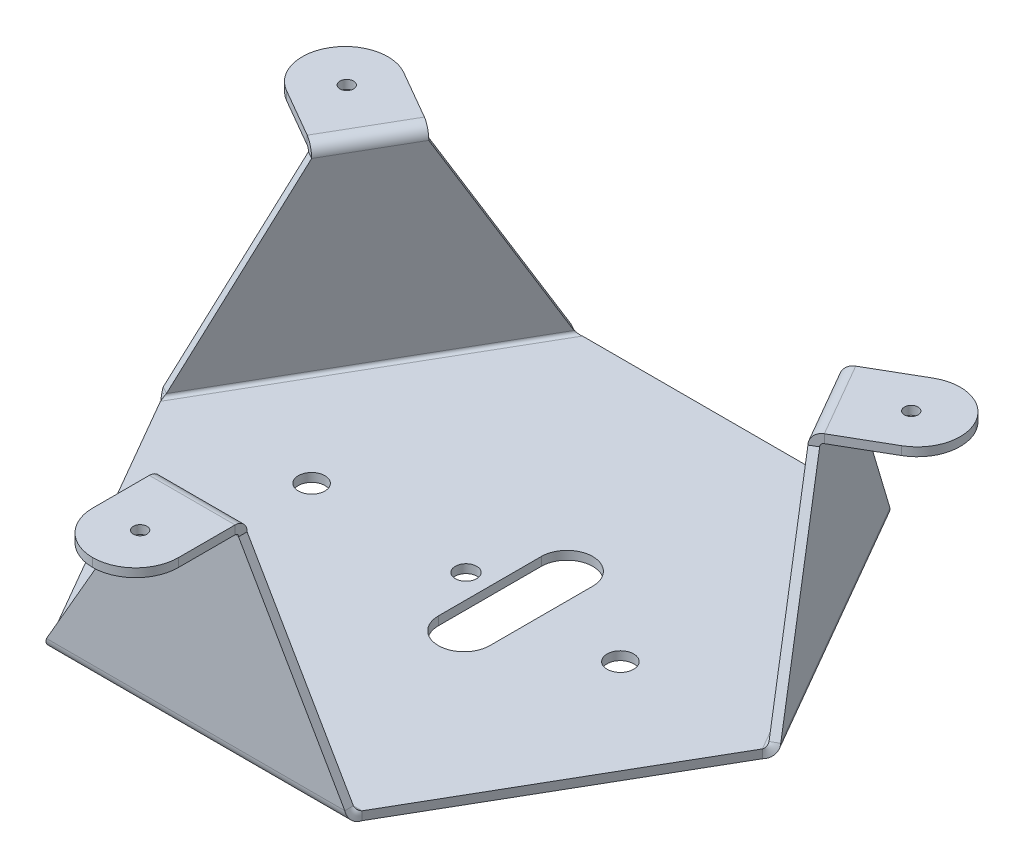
ISO-10303-21;
HEADER;
FILE_DESCRIPTION(('STEP AP214'),'2;1');
FILE_NAME('part.step','',(''),(''),'','','');
FILE_SCHEMA(('AUTOMOTIVE_DESIGN { 1 0 10303 214 1 1 1 1 }'));
ENDSEC;
DATA;
#1=APPLICATION_CONTEXT('core data for automotive mechanical design processes');
#2=APPLICATION_PROTOCOL_DEFINITION('international standard','automotive_design',2000,#1);
#3=PRODUCT_CONTEXT('',#1,'mechanical');
#4=PRODUCT('Part','Part','',(#3));
#5=PRODUCT_RELATED_PRODUCT_CATEGORY('part','',(#4));
#6=PRODUCT_DEFINITION_FORMATION('','',#4);
#7=PRODUCT_DEFINITION_CONTEXT('part definition',#1,'design');
#8=PRODUCT_DEFINITION('design','',#6,#7);
#9=PRODUCT_DEFINITION_SHAPE('','',#8);
#10=(LENGTH_UNIT() NAMED_UNIT(*) SI_UNIT(.MILLI.,.METRE.));
#11=(NAMED_UNIT(*) PLANE_ANGLE_UNIT() SI_UNIT($,.RADIAN.));
#12=(NAMED_UNIT(*) SI_UNIT($,.STERADIAN.) SOLID_ANGLE_UNIT());
#13=UNCERTAINTY_MEASURE_WITH_UNIT(LENGTH_MEASURE(1.E-05),#10,'distance_accuracy_value','');
#14=(GEOMETRIC_REPRESENTATION_CONTEXT(3) GLOBAL_UNCERTAINTY_ASSIGNED_CONTEXT((#13)) GLOBAL_UNIT_ASSIGNED_CONTEXT((#10,
#11,#12)) REPRESENTATION_CONTEXT('',''));
#15=CARTESIAN_POINT('',(0.,0.,0.));
#16=DIRECTION('',(0.,0.,1.));
#17=DIRECTION('',(1.,0.,0.));
#18=AXIS2_PLACEMENT_3D('',#15,#16,#17);
#19=CARTESIAN_POINT('',(96.2108379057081,59.5933619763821,-105.045980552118));
#20=DIRECTION('',(-0.866017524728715,0.,-0.500013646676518));
#21=DIRECTION('',(0.500013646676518,0.,-0.866017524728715));
#22=AXIS2_PLACEMENT_3D('',#19,#20,#21);
#23=PLANE('',#22);
#24=DIRECTION('',(-0.500013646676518,0.,0.866017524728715));
#25=VECTOR('',#24,1.);
#26=CARTESIAN_POINT('',(96.2108379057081,61.5933619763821,-105.045980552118));
#27=LINE('',#26,#25);
#28=CARTESIAN_POINT('',(70.187066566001,61.593361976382,-59.9731266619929));
#29=VERTEX_POINT('',#28);
#30=CARTESIAN_POINT('',(36.0222026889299,61.5933619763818,-0.800000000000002));
#31=VERTEX_POINT('',#30);
#32=EDGE_CURVE('E1028',#29,#31,#27,.T.);
#33=ORIENTED_EDGE('',*,*,#32,.T.);
#34=CARTESIAN_POINT('',(36.0222026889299,59.5933619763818,-0.800000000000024));
#35=CARTESIAN_POINT('',(36.0222026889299,61.5933619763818,-0.800000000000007));
#36=B_SPLINE_CURVE_WITH_KNOTS('',1,(#34,#35),.UNSPECIFIED.,.F.,.F.,(2,2),(0.,1.),.UNSPECIFIED.);
#37=CARTESIAN_POINT('',(36.0222026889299,59.5933619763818,-0.800000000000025));
#38=VERTEX_POINT('',#37);
#39=EDGE_CURVE('E642',#31,#38,#36,.F.);
#40=ORIENTED_EDGE('',*,*,#39,.T.);
#41=DIRECTION('',(-0.500013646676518,0.,0.866017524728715));
#42=VECTOR('',#41,1.);
#43=CARTESIAN_POINT('',(96.2108379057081,59.5933619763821,-105.045980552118));
#44=LINE('',#43,#42);
#45=CARTESIAN_POINT('',(70.187066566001,59.593361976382,-59.9731266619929));
#46=VERTEX_POINT('',#45);
#47=EDGE_CURVE('E1002',#46,#38,#44,.T.);
#48=ORIENTED_EDGE('',*,*,#47,.F.);
#49=CARTESIAN_POINT('',(70.187066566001,61.593361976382,-59.9731266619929));
#50=CARTESIAN_POINT('',(70.187066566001,59.593361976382,-59.9731266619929));
#51=B_SPLINE_CURVE_WITH_KNOTS('',1,(#49,#50),.UNSPECIFIED.,.F.,.F.,(2,2),(0.,1.),.UNSPECIFIED.);
#52=EDGE_CURVE('E1408',#29,#46,#51,.T.);
#53=ORIENTED_EDGE('',*,*,#52,.F.);
#54=EDGE_LOOP('',(#33,#40,#48,#53));
#55=FACE_BOUND('',#54,.T.);
#56=ADVANCED_FACE('F147',(#55),#23,.F.);
#57=CARTESIAN_POINT('',(-10.0015686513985,59.5933619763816,44.2728538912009));
#58=DIRECTION('',(0.866033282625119,0.,-0.499986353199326));
#59=DIRECTION('',(0.499986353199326,0.,0.866033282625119));
#60=AXIS2_PLACEMENT_3D('',#57,#58,#59);
#61=PLANE('',#60);
#62=DIRECTION('',(-0.499986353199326,0.,-0.866033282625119));
#63=VECTOR('',#62,1.);
#64=CARTESIAN_POINT('',(-10.0015686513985,59.5933619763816,44.2728538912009));
#65=LINE('',#64,#63);
#66=CARTESIAN_POINT('',(-36.0234459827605,59.5933619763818,-0.800000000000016));
#67=VERTEX_POINT('',#66);
#68=CARTESIAN_POINT('',(-70.1871003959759,59.593361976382,-59.9753386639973));
#69=VERTEX_POINT('',#68);
#70=EDGE_CURVE('E1003',#67,#69,#65,.T.);
#71=ORIENTED_EDGE('',*,*,#70,.F.);
#72=CARTESIAN_POINT('',(-36.0234459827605,61.5933619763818,-0.800000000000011));
#73=CARTESIAN_POINT('',(-36.0234459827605,59.5933619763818,-0.800000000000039));
#74=B_SPLINE_CURVE_WITH_KNOTS('',1,(#72,#73),.UNSPECIFIED.,.F.,.F.,(2,2),(0.,1.),.UNSPECIFIED.);
#75=CARTESIAN_POINT('',(-36.0234459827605,61.5933619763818,-0.800000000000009));
#76=VERTEX_POINT('',#75);
#77=EDGE_CURVE('E1103',#67,#76,#74,.F.);
#78=ORIENTED_EDGE('',*,*,#77,.T.);
#79=DIRECTION('',(-0.499986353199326,0.,-0.866033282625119));
#80=VECTOR('',#79,1.);
#81=CARTESIAN_POINT('',(-10.0015686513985,61.5933619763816,44.2728538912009));
#82=LINE('',#81,#80);
#83=CARTESIAN_POINT('',(-70.1871003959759,61.593361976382,-59.9753386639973));
#84=VERTEX_POINT('',#83);
#85=EDGE_CURVE('E996',#76,#84,#82,.T.);
#86=ORIENTED_EDGE('',*,*,#85,.T.);
#87=CARTESIAN_POINT('',(-70.187100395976,59.593361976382,-59.9753386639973));
#88=CARTESIAN_POINT('',(-70.187100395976,61.593361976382,-59.9753386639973));
#89=B_SPLINE_CURVE_WITH_KNOTS('',1,(#87,#88),.UNSPECIFIED.,.F.,.F.,(2,2),(0.,1.),.UNSPECIFIED.);
#90=EDGE_CURVE('E1294',#69,#84,#89,.T.);
#91=ORIENTED_EDGE('',*,*,#90,.F.);
#92=EDGE_LOOP('',(#71,#78,#86,#91));
#93=FACE_BOUND('',#92,.T.);
#94=ADVANCED_FACE('F1070',(#93),#61,.F.);
#95=CARTESIAN_POINT('',(182.413832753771,61.5933619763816,44.2728538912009));
#96=DIRECTION('',(0.,-1.,0.));
#97=DIRECTION('',(1.,0.,0.));
#98=AXIS2_PLACEMENT_3D('',#95,#96,#97);
#99=PLANE('',#98);
#100=DIRECTION('',(0.,0.,1.));
#101=VECTOR('',#100,1.);
#102=CARTESIAN_POINT('',(17.55,61.5933619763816,44.2728538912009));
#103=LINE('',#102,#101);
#104=CARTESIAN_POINT('',(17.55,61.5933619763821,-73.04765419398));
#105=VERTEX_POINT('',#104);
#106=CARTESIAN_POINT('',(17.55,61.593361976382,-49.04765419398));
#107=VERTEX_POINT('',#106);
#108=EDGE_CURVE('E418',#105,#107,#103,.T.);
#109=ORIENTED_EDGE('',*,*,#108,.T.);
#110=CARTESIAN_POINT('',(11.55,61.5933619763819,-49.04765419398));
#111=DIRECTION('',(0.,-1.,0.));
#112=DIRECTION('',(0.,0.,-1.));
#113=AXIS2_PLACEMENT_3D('',#110,#111,#112);
#114=CIRCLE('',#113,6.);
#115=CARTESIAN_POINT('',(5.55000000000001,61.593361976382,-49.04765419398));
#116=VERTEX_POINT('',#115);
#117=EDGE_CURVE('E421',#107,#116,#114,.T.);
#118=ORIENTED_EDGE('',*,*,#117,.T.);
#119=DIRECTION('',(0.,0.,-1.));
#120=VECTOR('',#119,1.);
#121=CARTESIAN_POINT('',(5.55,61.5933619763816,44.2728538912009));
#122=LINE('',#121,#120);
#123=CARTESIAN_POINT('',(5.55,61.593361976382,-73.04765419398));
#124=VERTEX_POINT('',#123);
#125=EDGE_CURVE('E413',#116,#124,#122,.T.);
#126=ORIENTED_EDGE('',*,*,#125,.T.);
#127=CARTESIAN_POINT('',(11.55,61.593361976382,-73.04765419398));
#128=DIRECTION('',(0.,-1.,0.));
#129=DIRECTION('',(0.,0.,-1.));
#130=AXIS2_PLACEMENT_3D('',#127,#128,#129);
#131=CIRCLE('',#130,6.);
#132=EDGE_CURVE('E393',#124,#105,#131,.T.);
#133=ORIENTED_EDGE('',*,*,#132,.T.);
#134=EDGE_LOOP('',(#109,#118,#126,#133));
#135=FACE_BOUND('',#134,.T.);
#136=CARTESIAN_POINT('',(36.,61.593361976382,-61.0476541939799));
#137=DIRECTION('',(0.,-1.,0.));
#138=DIRECTION('',(1.,0.,0.));
#139=AXIS2_PLACEMENT_3D('',#136,#137,#138);
#140=CIRCLE('',#139,3.1);
#141=CARTESIAN_POINT('',(39.1,61.593361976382,-61.0476541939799));
#142=VERTEX_POINT('',#141);
#143=EDGE_CURVE('E984',#142,#142,#140,.T.);
#144=ORIENTED_EDGE('',*,*,#143,.T.);
#145=EDGE_LOOP('',(#144));
#146=FACE_BOUND('',#145,.T.);
#147=CARTESIAN_POINT('',(0.,61.593361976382,-61.04765419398));
#148=DIRECTION('',(0.,-1.,0.));
#149=DIRECTION('',(1.,0.,0.));
#150=AXIS2_PLACEMENT_3D('',#147,#148,#149);
#151=CIRCLE('',#150,2.5);
#152=CARTESIAN_POINT('',(2.50000000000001,61.593361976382,-61.04765419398));
#153=VERTEX_POINT('',#152);
#154=EDGE_CURVE('E990',#153,#153,#151,.T.);
#155=ORIENTED_EDGE('',*,*,#154,.T.);
#156=EDGE_LOOP('',(#155));
#157=FACE_BOUND('',#156,.T.);
#158=CARTESIAN_POINT('',(-36.,61.593361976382,-61.04765419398));
#159=DIRECTION('',(0.,-1.,0.));
#160=DIRECTION('',(1.,0.,0.));
#161=AXIS2_PLACEMENT_3D('',#158,#159,#160);
#162=CIRCLE('',#161,3.1);
#163=CARTESIAN_POINT('',(-32.9,61.593361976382,-61.04765419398));
#164=VERTEX_POINT('',#163);
#165=EDGE_CURVE('E983',#164,#164,#162,.T.);
#166=ORIENTED_EDGE('',*,*,#165,.T.);
#167=EDGE_LOOP('',(#166));
#168=FACE_BOUND('',#167,.T.);
#169=ORIENTED_EDGE('',*,*,#85,.F.);
#170=DIRECTION('',(1.,0.,0.));
#171=VECTOR('',#170,1.);
#172=CARTESIAN_POINT('',(182.413832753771,61.5933619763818,-0.800000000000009));
#173=LINE('',#172,#171);
#174=EDGE_CURVE('E1449',#76,#31,#173,.T.);
#175=ORIENTED_EDGE('',*,*,#174,.T.);
#176=ORIENTED_EDGE('',*,*,#32,.F.);
#177=DIRECTION('',(0.499972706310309,0.,0.86604116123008));
#178=VECTOR('',#177,1.);
#179=CARTESIAN_POINT('',(143.378886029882,61.5933619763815,66.8080506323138));
#180=LINE('',#179,#178);
#181=CARTESIAN_POINT('',(34.1662086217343,61.5933619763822,-122.367623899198));
#182=VERTEX_POINT('',#181);
#183=EDGE_CURVE('E1409',#182,#29,#180,.T.);
#184=ORIENTED_EDGE('',*,*,#183,.F.);
#185=DIRECTION('',(0.999999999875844,0.,1.57578964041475E-05));
#186=VECTOR('',#185,1.);
#187=CARTESIAN_POINT('',(-86.2094512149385,61.5933619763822,-122.369520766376));
#188=LINE('',#187,#186);
#189=CARTESIAN_POINT('',(-34.1642760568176,61.5933619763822,-122.368700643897));
#190=VERTEX_POINT('',#189);
#191=EDGE_CURVE('E1324',#190,#182,#188,.T.);
#192=ORIENTED_EDGE('',*,*,#191,.F.);
#193=DIRECTION('',(0.500000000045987,0.,-0.866025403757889));
#194=VECTOR('',#193,1.);
#195=CARTESIAN_POINT('',(-52.1776586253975,61.5933619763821,-91.1686068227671));
#196=LINE('',#195,#194);
#197=EDGE_CURVE('E1313',#84,#190,#196,.T.);
#198=ORIENTED_EDGE('',*,*,#197,.F.);
#199=EDGE_LOOP('',(#169,#175,#176,#184,#192,#198));
#200=FACE_BOUND('',#199,.T.);
#201=ADVANCED_FACE('F1076',(#135,#146,#157,#168,#200),#99,.F.);
#202=CARTESIAN_POINT('',(182.413832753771,59.5933619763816,44.2728538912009));
#203=DIRECTION('',(0.,-1.,0.));
#204=DIRECTION('',(1.,0.,0.));
#205=AXIS2_PLACEMENT_3D('',#202,#203,#204);
#206=PLANE('',#205);
#207=CARTESIAN_POINT('',(11.55,59.593361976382,-49.04765419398));
#208=DIRECTION('',(0.,-1.,0.));
#209=DIRECTION('',(0.,0.,-1.));
#210=AXIS2_PLACEMENT_3D('',#207,#208,#209);
#211=CIRCLE('',#210,6.);
#212=CARTESIAN_POINT('',(17.55,59.5933619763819,-49.04765419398));
#213=VERTEX_POINT('',#212);
#214=CARTESIAN_POINT('',(5.55,59.593361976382,-49.0476541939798));
#215=VERTEX_POINT('',#214);
#216=EDGE_CURVE('E172',#213,#215,#211,.T.);
#217=ORIENTED_EDGE('',*,*,#216,.F.);
#218=DIRECTION('',(0.,0.,1.));
#219=VECTOR('',#218,1.);
#220=CARTESIAN_POINT('',(17.55,59.5933619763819,-49.04765419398));
#221=LINE('',#220,#219);
#222=CARTESIAN_POINT('',(17.55,59.593361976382,-73.04765419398));
#223=VERTEX_POINT('',#222);
#224=EDGE_CURVE('E406',#223,#213,#221,.T.);
#225=ORIENTED_EDGE('',*,*,#224,.F.);
#226=CARTESIAN_POINT('',(11.55,59.593361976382,-73.04765419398));
#227=DIRECTION('',(0.,-1.,0.));
#228=DIRECTION('',(0.,0.,-1.));
#229=AXIS2_PLACEMENT_3D('',#226,#227,#228);
#230=CIRCLE('',#229,6.);
#231=CARTESIAN_POINT('',(5.55,59.593361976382,-73.04765419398));
#232=VERTEX_POINT('',#231);
#233=EDGE_CURVE('E390',#232,#223,#230,.T.);
#234=ORIENTED_EDGE('',*,*,#233,.F.);
#235=DIRECTION('',(0.,0.,-1.));
#236=VECTOR('',#235,1.);
#237=CARTESIAN_POINT('',(5.55000000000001,59.593361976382,-49.04765419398));
#238=LINE('',#237,#236);
#239=EDGE_CURVE('E399',#215,#232,#238,.T.);
#240=ORIENTED_EDGE('',*,*,#239,.F.);
#241=EDGE_LOOP('',(#217,#225,#234,#240));
#242=FACE_BOUND('',#241,.T.);
#243=DIRECTION('',(1.,0.,0.));
#244=VECTOR('',#243,1.);
#245=CARTESIAN_POINT('',(182.413832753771,59.5933619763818,-0.800000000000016));
#246=LINE('',#245,#244);
#247=EDGE_CURVE('E1023',#67,#38,#246,.T.);
#248=ORIENTED_EDGE('',*,*,#247,.F.);
#249=ORIENTED_EDGE('',*,*,#70,.T.);
#250=DIRECTION('',(0.500000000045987,0.,-0.866025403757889));
#251=VECTOR('',#250,1.);
#252=CARTESIAN_POINT('',(-52.1776586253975,59.5933619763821,-91.1686068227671));
#253=LINE('',#252,#251);
#254=CARTESIAN_POINT('',(-34.1642760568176,59.5933619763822,-122.368700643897));
#255=VERTEX_POINT('',#254);
#256=EDGE_CURVE('E1004',#69,#255,#253,.T.);
#257=ORIENTED_EDGE('',*,*,#256,.T.);
#258=DIRECTION('',(0.999999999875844,0.,1.57578964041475E-05));
#259=VECTOR('',#258,1.);
#260=CARTESIAN_POINT('',(-86.2094512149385,59.5933619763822,-122.369520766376));
#261=LINE('',#260,#259);
#262=CARTESIAN_POINT('',(34.1662086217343,59.5933619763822,-122.367623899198));
#263=VERTEX_POINT('',#262);
#264=EDGE_CURVE('E999',#255,#263,#261,.T.);
#265=ORIENTED_EDGE('',*,*,#264,.T.);
#266=DIRECTION('',(0.499972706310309,0.,0.86604116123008));
#267=VECTOR('',#266,1.);
#268=CARTESIAN_POINT('',(143.378886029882,59.5933619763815,66.8080506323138));
#269=LINE('',#268,#267);
#270=EDGE_CURVE('E1014',#263,#46,#269,.T.);
#271=ORIENTED_EDGE('',*,*,#270,.T.);
#272=ORIENTED_EDGE('',*,*,#47,.T.);
#273=EDGE_LOOP('',(#248,#249,#257,#265,#271,#272));
#274=FACE_BOUND('',#273,.T.);
#275=CARTESIAN_POINT('',(-36.,59.593361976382,-61.04765419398));
#276=DIRECTION('',(0.,-1.,0.));
#277=DIRECTION('',(1.,0.,0.));
#278=AXIS2_PLACEMENT_3D('',#275,#276,#277);
#279=CIRCLE('',#278,3.1);
#280=CARTESIAN_POINT('',(-32.9,59.593361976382,-61.04765419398));
#281=VERTEX_POINT('',#280);
#282=EDGE_CURVE('E987',#281,#281,#279,.T.);
#283=ORIENTED_EDGE('',*,*,#282,.F.);
#284=EDGE_LOOP('',(#283));
#285=FACE_BOUND('',#284,.T.);
#286=CARTESIAN_POINT('',(0.,59.593361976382,-61.04765419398));
#287=DIRECTION('',(0.,-1.,0.));
#288=DIRECTION('',(1.,0.,0.));
#289=AXIS2_PLACEMENT_3D('',#286,#287,#288);
#290=CIRCLE('',#289,2.5);
#291=CARTESIAN_POINT('',(2.50000000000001,59.593361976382,-61.04765419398));
#292=VERTEX_POINT('',#291);
#293=EDGE_CURVE('E993',#292,#292,#290,.T.);
#294=ORIENTED_EDGE('',*,*,#293,.F.);
#295=EDGE_LOOP('',(#294));
#296=FACE_BOUND('',#295,.T.);
#297=CARTESIAN_POINT('',(36.,59.593361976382,-61.04765419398));
#298=DIRECTION('',(0.,-1.,0.));
#299=DIRECTION('',(1.,0.,0.));
#300=AXIS2_PLACEMENT_3D('',#297,#298,#299);
#301=CIRCLE('',#300,3.1);
#302=CARTESIAN_POINT('',(39.1,59.593361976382,-61.04765419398));
#303=VERTEX_POINT('',#302);
#304=EDGE_CURVE('E975',#303,#303,#301,.T.);
#305=ORIENTED_EDGE('',*,*,#304,.F.);
#306=EDGE_LOOP('',(#305));
#307=FACE_BOUND('',#306,.T.);
#308=ADVANCED_FACE('F403',(#242,#274,#285,#296,#307),#206,.T.);
#309=CARTESIAN_POINT('',(-86.2094512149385,59.5933619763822,-122.369520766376));
#310=DIRECTION('',(-1.57578964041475E-05,0.,0.999999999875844));
#311=DIRECTION('',(-0.999999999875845,0.,-1.57578964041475E-05));
#312=AXIS2_PLACEMENT_3D('',#309,#310,#311);
#313=PLANE('',#312);
#314=CARTESIAN_POINT('',(34.1662086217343,59.5933619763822,-122.367623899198));
#315=CARTESIAN_POINT('',(34.1662086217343,61.5933619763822,-122.367623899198));
#316=B_SPLINE_CURVE_WITH_KNOTS('',1,(#314,#315),.UNSPECIFIED.,.F.,.F.,(2,2),(0.,1.),.UNSPECIFIED.);
#317=EDGE_CURVE('E1384',#263,#182,#316,.T.);
#318=ORIENTED_EDGE('',*,*,#317,.F.);
#319=ORIENTED_EDGE('',*,*,#264,.F.);
#320=CARTESIAN_POINT('',(-34.1642760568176,61.5933619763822,-122.368700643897));
#321=CARTESIAN_POINT('',(-34.1642760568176,59.5933619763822,-122.368700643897));
#322=B_SPLINE_CURVE_WITH_KNOTS('',1,(#320,#321),.UNSPECIFIED.,.F.,.F.,(2,2),(0.,1.),.UNSPECIFIED.);
#323=EDGE_CURVE('E1315',#190,#255,#322,.T.);
#324=ORIENTED_EDGE('',*,*,#323,.F.);
#325=ORIENTED_EDGE('',*,*,#191,.T.);
#326=EDGE_LOOP('',(#318,#319,#324,#325));
#327=FACE_BOUND('',#326,.T.);
#328=ADVANCED_FACE('F1421',(#327),#313,.F.);
#329=CARTESIAN_POINT('',(0.,59.593361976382,-61.04765419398));
#330=DIRECTION('',(0.,1.,0.));
#331=DIRECTION('',(-1.,0.,0.));
#332=AXIS2_PLACEMENT_3D('',#329,#330,#331);
#333=CYLINDRICAL_SURFACE('',#332,2.5);
#334=ORIENTED_EDGE('',*,*,#293,.T.);
#335=EDGE_LOOP('',(#334));
#336=FACE_BOUND('',#335,.T.);
#337=ORIENTED_EDGE('',*,*,#154,.F.);
#338=EDGE_LOOP('',(#337));
#339=FACE_BOUND('',#338,.T.);
#340=ADVANCED_FACE('F1430',(#336,#339),#333,.F.);
#341=CARTESIAN_POINT('',(-36.,59.593361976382,-61.04765419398));
#342=DIRECTION('',(0.,1.,0.));
#343=DIRECTION('',(-1.,0.,0.));
#344=AXIS2_PLACEMENT_3D('',#341,#342,#343);
#345=CYLINDRICAL_SURFACE('',#344,3.1);
#346=ORIENTED_EDGE('',*,*,#282,.T.);
#347=EDGE_LOOP('',(#346));
#348=FACE_BOUND('',#347,.T.);
#349=ORIENTED_EDGE('',*,*,#165,.F.);
#350=EDGE_LOOP('',(#349));
#351=FACE_BOUND('',#350,.T.);
#352=ADVANCED_FACE('F1433',(#348,#351),#345,.F.);
#353=CARTESIAN_POINT('',(36.,59.593361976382,-61.04765419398));
#354=DIRECTION('',(0.,1.,0.));
#355=DIRECTION('',(-1.,0.,0.));
#356=AXIS2_PLACEMENT_3D('',#353,#354,#355);
#357=CYLINDRICAL_SURFACE('',#356,3.1);
#358=ORIENTED_EDGE('',*,*,#304,.T.);
#359=EDGE_LOOP('',(#358));
#360=FACE_BOUND('',#359,.T.);
#361=ORIENTED_EDGE('',*,*,#143,.F.);
#362=EDGE_LOOP('',(#361));
#363=FACE_BOUND('',#362,.T.);
#364=ADVANCED_FACE('F947',(#360,#363),#357,.F.);
#365=CARTESIAN_POINT('',(-70.187100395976,59.593361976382,-59.9753386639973));
#366=CARTESIAN_POINT('',(-70.4529400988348,59.593361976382,-60.2480515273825));
#367=CARTESIAN_POINT('',(-70.7185661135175,59.6662384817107,-60.5206011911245));
#368=CARTESIAN_POINT('',(-71.2018331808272,59.9467600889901,-61.0380362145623));
#369=CARTESIAN_POINT('',(-71.4191990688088,60.1542948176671,-61.2827427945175));
#370=CARTESIAN_POINT('',(-71.7648523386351,60.6726311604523,-61.7207264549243));
#371=CARTESIAN_POINT('',(-71.8929631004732,60.9832288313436,-61.9139015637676));
#372=CARTESIAN_POINT('',(-72.0326627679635,61.6604679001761,-62.2329778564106));
#373=CARTESIAN_POINT('',(-72.0441647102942,62.0267816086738,-62.3588089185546));
#374=CARTESIAN_POINT('',(-71.9925365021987,62.3933619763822,-62.4482315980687));
#375=CARTESIAN_POINT('',(-70.187100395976,61.593361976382,-59.9753386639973));
#376=CARTESIAN_POINT('',(-70.2261743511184,61.593361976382,-60.1171192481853));
#377=CARTESIAN_POINT('',(-70.2652054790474,61.6141838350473,-60.2588533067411));
#378=CARTESIAN_POINT('',(-70.3295395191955,61.6943328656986,-60.5344172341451));
#379=CARTESIAN_POINT('',(-70.3547729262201,61.7536285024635,-60.668196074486));
#380=CARTESIAN_POINT('',(-70.3797887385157,61.9017246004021,-60.9210596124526));
#381=CARTESIAN_POINT('',(-70.3795206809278,61.9904667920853,-61.0401151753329));
#382=CARTESIAN_POINT('',(-70.3456926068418,62.1839636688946,-61.2590051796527));
#383=CARTESIAN_POINT('',(-70.3121099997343,62.2886326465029,-61.3588156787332));
#384=CARTESIAN_POINT('',(-70.2604856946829,62.393361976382,-61.4482315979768));
#385=B_SPLINE_SURFACE_WITH_KNOTS('',1,3,((#365,#366,#367,#368,#369,#370,#371,#372,#373,#374),
(#375,#376,#377,#378,#379,#380,#381,#382,#383,#384)),.UNSPECIFIED.,.F.,.F.,.F.,(2,2),(4,2,2,2,
4),(0.,1.),(0.,0.25,0.5,0.75,1.),.UNSPECIFIED.);
#386=CARTESIAN_POINT('',(-70.187100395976,61.593361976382,-59.9753386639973));
#387=CARTESIAN_POINT('',(-70.2261743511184,61.593361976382,-60.1171192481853));
#388=CARTESIAN_POINT('',(-70.2652054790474,61.6141838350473,-60.2588533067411));
#389=CARTESIAN_POINT('',(-70.3295395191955,61.6943328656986,-60.5344172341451));
#390=CARTESIAN_POINT('',(-70.3547729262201,61.7536285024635,-60.668196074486));
#391=CARTESIAN_POINT('',(-70.3797887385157,61.9017246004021,-60.9210596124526));
#392=CARTESIAN_POINT('',(-70.3795206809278,61.9904667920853,-61.0401151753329));
#393=CARTESIAN_POINT('',(-70.3456926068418,62.1839636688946,-61.2590051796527));
#394=CARTESIAN_POINT('',(-70.3121099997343,62.2886326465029,-61.3588156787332));
#395=CARTESIAN_POINT('',(-70.2604856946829,62.393361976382,-61.4482315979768));
#396=B_SPLINE_CURVE_WITH_KNOTS('',3,(#386,#387,#388,#389,#390,#391,#392,#393,#394,#395),
.UNSPECIFIED.,.F.,.F.,(4,2,2,2,4),(0.,0.25,0.5,0.75,1.),.UNSPECIFIED.);
#397=CARTESIAN_POINT('',(-70.2604856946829,62.393361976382,-61.4482315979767));
#398=VERTEX_POINT('',#397);
#399=EDGE_CURVE('E852',#84,#398,#396,.T.);
#400=CARTESIAN_POINT('',(-70.2604856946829,62.393361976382,-61.4482315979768));
#401=CARTESIAN_POINT('',(-71.9925365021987,62.3933619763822,-62.4482315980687));
#402=B_SPLINE_CURVE_WITH_KNOTS('',1,(#400,#401),.UNSPECIFIED.,.F.,.F.,(2,2),(0.,1.),.UNSPECIFIED.);
#403=CARTESIAN_POINT('',(-71.9925365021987,62.393361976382,-62.4482315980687));
#404=VERTEX_POINT('',#403);
#405=EDGE_CURVE('E1035',#404,#398,#402,.F.);
#406=CARTESIAN_POINT('',(-71.9925365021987,62.3933619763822,-62.4482315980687));
#407=CARTESIAN_POINT('',(-72.0441647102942,62.0267816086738,-62.3588089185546));
#408=CARTESIAN_POINT('',(-72.0326627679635,61.6604679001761,-62.2329778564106));
#409=CARTESIAN_POINT('',(-71.8929631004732,60.9832288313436,-61.9139015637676));
#410=CARTESIAN_POINT('',(-71.7648523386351,60.6726311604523,-61.7207264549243));
#411=CARTESIAN_POINT('',(-71.4191990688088,60.1542948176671,-61.2827427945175));
#412=CARTESIAN_POINT('',(-71.2018331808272,59.9467600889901,-61.0380362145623));
#413=CARTESIAN_POINT('',(-70.7185661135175,59.6662384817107,-60.5206011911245));
#414=CARTESIAN_POINT('',(-70.4529400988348,59.593361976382,-60.2480515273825));
#415=CARTESIAN_POINT('',(-70.187100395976,59.593361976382,-59.9753386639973));
#416=B_SPLINE_CURVE_WITH_KNOTS('',3,(#406,#407,#408,#409,#410,#411,#412,#413,#414,#415),
.UNSPECIFIED.,.F.,.F.,(4,2,2,2,4),(0.,0.25,0.5,0.75,1.),.UNSPECIFIED.);
#417=EDGE_CURVE('E1282',#69,#404,#416,.F.);
#418=ORIENTED_EDGE('',*,*,#90,.T.);
#419=ORIENTED_EDGE('',*,*,#399,.T.);
#420=ORIENTED_EDGE('',*,*,#405,.F.);
#421=ORIENTED_EDGE('',*,*,#417,.F.);
#422=EDGE_LOOP('',(#418,#419,#420,#421));
#423=FACE_BOUND('',#422,.T.);
#424=ADVANCED_FACE('F884',(#423),#385,.T.);
#425=CARTESIAN_POINT('',(-37.2085371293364,62.3933619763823,-122.695885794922));
#426=CARTESIAN_POINT('',(-37.1569126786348,62.0267816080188,-122.785301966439));
#427=CARTESIAN_POINT('',(-37.0421925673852,61.6604679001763,-122.838250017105));
#428=CARTESIAN_POINT('',(-36.6960220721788,60.9832288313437,-122.876791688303));
#429=CARTESIAN_POINT('',(-36.4646758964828,60.6726311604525,-122.86242556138));
#430=CARTESIAN_POINT('',(-35.9125517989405,60.1542948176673,-122.782059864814));
#431=CARTESIAN_POINT('',(-35.5919504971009,59.9467600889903,-122.71616226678));
#432=CARTESIAN_POINT('',(-34.9022126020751,59.6662384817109,-122.556345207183));
#433=CARTESIAN_POINT('',(-34.5333684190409,59.5933619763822,-122.462574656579));
#434=CARTESIAN_POINT('',(-34.1642760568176,59.5933619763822,-122.368700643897));
#435=CARTESIAN_POINT('',(-35.4764863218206,62.3933619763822,-121.69588579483));
#436=CARTESIAN_POINT('',(-35.4248657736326,62.2886326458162,-121.785295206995));
#437=CARTESIAN_POINT('',(-35.3552224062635,62.1839636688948,-121.864277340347));
#438=CARTESIAN_POINT('',(-35.1825796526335,61.9904667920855,-122.003005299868));
#439=CARTESIAN_POINT('',(-35.0796122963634,61.9017246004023,-122.062758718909));
#440=CARTESIAN_POINT('',(-34.8481256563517,61.7536285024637,-122.167513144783));
#441=CARTESIAN_POINT('',(-34.7196568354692,61.6943328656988,-122.212543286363));
#442=CARTESIAN_POINT('',(-34.4488519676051,61.6141838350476,-122.2945973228));
#443=CARTESIAN_POINT('',(-34.3065948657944,61.5933619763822,-122.33165589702));
#444=CARTESIAN_POINT('',(-34.1642760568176,61.5933619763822,-122.368700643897));
#445=B_SPLINE_SURFACE_WITH_KNOTS('',1,3,((#425,#426,#427,#428,#429,#430,#431,#432,#433,#434),
(#435,#436,#437,#438,#439,#440,#441,#442,#443,#444)),.UNSPECIFIED.,.F.,.F.,.F.,(2,2),(4,2,2,2,
4),(0.,1.),(0.,0.25,0.5,0.75,1.),.UNSPECIFIED.);
#446=CARTESIAN_POINT('',(-35.4764863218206,62.3933619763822,-121.69588579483));
#447=CARTESIAN_POINT('',(-35.4248657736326,62.2886326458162,-121.785295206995));
#448=CARTESIAN_POINT('',(-35.3552224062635,62.1839636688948,-121.864277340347));
#449=CARTESIAN_POINT('',(-35.1825796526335,61.9904667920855,-122.003005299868));
#450=CARTESIAN_POINT('',(-35.0796122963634,61.9017246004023,-122.062758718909));
#451=CARTESIAN_POINT('',(-34.8481256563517,61.7536285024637,-122.167513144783));
#452=CARTESIAN_POINT('',(-34.7196568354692,61.6943328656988,-122.212543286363));
#453=CARTESIAN_POINT('',(-34.4488519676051,61.6141838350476,-122.2945973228));
#454=CARTESIAN_POINT('',(-34.3065948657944,61.5933619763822,-122.33165589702));
#455=CARTESIAN_POINT('',(-34.1642760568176,61.5933619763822,-122.368700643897));
#456=B_SPLINE_CURVE_WITH_KNOTS('',3,(#446,#447,#448,#449,#450,#451,#452,#453,#454,#455),
.UNSPECIFIED.,.F.,.F.,(4,2,2,2,4),(0.,0.25,0.5,0.75,1.),.UNSPECIFIED.);
#457=CARTESIAN_POINT('',(-35.4764863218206,62.3933619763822,-121.69588579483));
#458=VERTEX_POINT('',#457);
#459=EDGE_CURVE('E916',#458,#190,#456,.T.);
#460=CARTESIAN_POINT('',(-34.1642760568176,59.5933619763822,-122.368700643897));
#461=CARTESIAN_POINT('',(-34.5333684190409,59.5933619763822,-122.462574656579));
#462=CARTESIAN_POINT('',(-34.9022126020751,59.6662384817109,-122.556345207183));
#463=CARTESIAN_POINT('',(-35.5919504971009,59.9467600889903,-122.71616226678));
#464=CARTESIAN_POINT('',(-35.9125517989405,60.1542948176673,-122.782059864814));
#465=CARTESIAN_POINT('',(-36.4646758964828,60.6726311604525,-122.86242556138));
#466=CARTESIAN_POINT('',(-36.6960220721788,60.9832288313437,-122.876791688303));
#467=CARTESIAN_POINT('',(-37.0421925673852,61.6604679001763,-122.838250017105));
#468=CARTESIAN_POINT('',(-37.1569126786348,62.0267816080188,-122.785301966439));
#469=CARTESIAN_POINT('',(-37.2085371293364,62.3933619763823,-122.695885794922));
#470=B_SPLINE_CURVE_WITH_KNOTS('',3,(#460,#461,#462,#463,#464,#465,#466,#467,#468,#469),
.UNSPECIFIED.,.F.,.F.,(4,2,2,2,4),(0.,0.25,0.5,0.75,1.),.UNSPECIFIED.);
#471=CARTESIAN_POINT('',(-37.2085371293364,62.3933619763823,-122.695885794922));
#472=VERTEX_POINT('',#471);
#473=EDGE_CURVE('E909',#472,#255,#470,.F.);
#474=CARTESIAN_POINT('',(-37.2085371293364,62.3933619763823,-122.695885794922));
#475=CARTESIAN_POINT('',(-35.4764863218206,62.3933619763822,-121.69588579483));
#476=B_SPLINE_CURVE_WITH_KNOTS('',1,(#474,#475),.UNSPECIFIED.,.F.,.F.,(2,2),(0.,1.),.UNSPECIFIED.);
#477=EDGE_CURVE('E853',#458,#472,#476,.F.);
#478=ORIENTED_EDGE('',*,*,#459,.T.);
#479=ORIENTED_EDGE('',*,*,#323,.T.);
#480=ORIENTED_EDGE('',*,*,#473,.F.);
#481=ORIENTED_EDGE('',*,*,#477,.F.);
#482=EDGE_LOOP('',(#478,#479,#480,#481));
#483=FACE_BOUND('',#482,.T.);
#484=ADVANCED_FACE('F882',(#483),#445,.T.);
#485=CARTESIAN_POINT('',(-88.5259472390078,62.3933619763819,-28.2115241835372));
#486=DIRECTION('',(0.500000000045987,0.,-0.866025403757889));
#487=DIRECTION('',(0.866025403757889,0.,0.500000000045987));
#488=AXIS2_PLACEMENT_3D('',#485,#486,#487);
#489=CYLINDRICAL_SURFACE('',#488,2.8);
#490=DIRECTION('',(0.500000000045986,0.,-0.866025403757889));
#491=VECTOR('',#490,1.);
#492=CARTESIAN_POINT('',(-54.6025297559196,62.3933619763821,-92.5686068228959));
#493=LINE('',#492,#491);
#494=EDGE_CURVE('E864',#404,#472,#493,.T.);
#495=ORIENTED_EDGE('',*,*,#494,.T.);
#496=ORIENTED_EDGE('',*,*,#473,.T.);
#497=ORIENTED_EDGE('',*,*,#256,.F.);
#498=ORIENTED_EDGE('',*,*,#417,.T.);
#499=EDGE_LOOP('',(#495,#496,#497,#498));
#500=FACE_BOUND('',#499,.T.);
#501=ADVANCED_FACE('F871',(#500),#489,.T.);
#502=CARTESIAN_POINT('',(-88.5259472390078,62.3933619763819,-28.2115241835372));
#503=DIRECTION('',(0.500000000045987,0.,-0.866025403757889));
#504=DIRECTION('',(0.866025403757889,0.,0.500000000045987));
#505=AXIS2_PLACEMENT_3D('',#502,#503,#504);
#506=CYLINDRICAL_SURFACE('',#505,0.8);
#507=DIRECTION('',(0.500000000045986,0.,-0.866025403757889));
#508=VECTOR('',#507,1.);
#509=CARTESIAN_POINT('',(-52.8704789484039,62.3933619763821,-91.5686068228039));
#510=LINE('',#509,#508);
#511=EDGE_CURVE('E1052',#398,#458,#510,.T.);
#512=ORIENTED_EDGE('',*,*,#511,.F.);
#513=ORIENTED_EDGE('',*,*,#399,.F.);
#514=ORIENTED_EDGE('',*,*,#197,.T.);
#515=ORIENTED_EDGE('',*,*,#459,.F.);
#516=EDGE_LOOP('',(#512,#513,#514,#515));
#517=FACE_BOUND('',#516,.T.);
#518=ADVANCED_FACE('F881',(#517),#506,.F.);
#519=CARTESIAN_POINT('',(-54.6025297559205,-210.635267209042,-92.5686068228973));
#520=DIRECTION('',(-0.866025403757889,0.,-0.500000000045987));
#521=DIRECTION('',(0.250000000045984,-0.866025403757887,-0.433012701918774));
#522=AXIS2_PLACEMENT_3D('',#519,#520,#521);
#523=PLANE('',#522);
#524=ORIENTED_EDGE('',*,*,#494,.F.);
#525=DIRECTION('',(0.250006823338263,0.866017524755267,-0.433024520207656));
#526=VECTOR('',#525,1.);
#527=CARTESIAN_POINT('',(-102.706380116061,-43.998641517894,-9.25029396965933));
#528=LINE('',#527,#526);
#529=CARTESIAN_POINT('',(-59.6000858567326,105.320508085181,-83.912585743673));
#530=VERTEX_POINT('',#529);
#531=EDGE_CURVE('E857',#404,#530,#528,.T.);
#532=ORIENTED_EDGE('',*,*,#531,.T.);
#533=DIRECTION('',(0.500000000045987,0.,-0.866025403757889));
#534=VECTOR('',#533,1.);
#535=CARTESIAN_POINT('',(-59.6000858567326,105.320508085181,-83.912585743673));
#536=LINE('',#535,#534);
#537=CARTESIAN_POINT('',(-49.6000858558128,105.320508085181,-101.233093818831));
#538=VERTEX_POINT('',#537);
#539=EDGE_CURVE('E854',#530,#538,#536,.T.);
#540=ORIENTED_EDGE('',*,*,#539,.T.);
#541=DIRECTION('',(0.249993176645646,-0.866033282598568,-0.433000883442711));
#542=VECTOR('',#541,1.);
#543=CARTESIAN_POINT('',(-49.6000858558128,105.320508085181,-101.233093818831));
#544=LINE('',#543,#542);
#545=EDGE_CURVE('E856',#538,#472,#544,.T.);
#546=ORIENTED_EDGE('',*,*,#545,.T.);
#547=EDGE_LOOP('',(#524,#532,#540,#546));
#548=FACE_BOUND('',#547,.T.);
#549=ADVANCED_FACE('F816',(#548),#523,.T.);
#550=CARTESIAN_POINT('',(-102.706380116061,-43.998641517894,-9.25029396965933));
#551=DIRECTION('',(0.433008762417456,-0.500013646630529,-0.749993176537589));
#552=DIRECTION('',(-0.250006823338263,-0.866017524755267,0.433024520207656));
#553=AXIS2_PLACEMENT_3D('',#550,#551,#552);
#554=PLANE('',#553);
#555=ORIENTED_EDGE('',*,*,#531,.F.);
#556=ORIENTED_EDGE('',*,*,#405,.T.);
#557=DIRECTION('',(0.250006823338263,0.866017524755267,-0.433024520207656));
#558=VECTOR('',#557,1.);
#559=CARTESIAN_POINT('',(-100.974329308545,-43.998641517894,-8.25029396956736));
#560=LINE('',#559,#558);
#561=CARTESIAN_POINT('',(-57.8680350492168,105.320508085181,-82.9125857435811));
#562=VERTEX_POINT('',#561);
#563=EDGE_CURVE('E1265',#398,#562,#560,.T.);
#564=ORIENTED_EDGE('',*,*,#563,.T.);
#565=DIRECTION('',(0.866025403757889,0.,0.500000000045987));
#566=VECTOR('',#565,1.);
#567=CARTESIAN_POINT('',(-59.6000858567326,105.320508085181,-83.912585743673));
#568=LINE('',#567,#566);
#569=EDGE_CURVE('E858',#530,#562,#568,.T.);
#570=ORIENTED_EDGE('',*,*,#569,.F.);
#571=EDGE_LOOP('',(#555,#556,#564,#570));
#572=FACE_BOUND('',#571,.T.);
#573=ADVANCED_FACE('F1054',(#572),#554,.F.);
#574=CARTESIAN_POINT('',(-52.8704789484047,-210.635267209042,-91.5686068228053));
#575=DIRECTION('',(-0.866025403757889,0.,-0.500000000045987));
#576=DIRECTION('',(0.250000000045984,-0.866025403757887,-0.433012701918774));
#577=AXIS2_PLACEMENT_3D('',#574,#575,#576);
#578=PLANE('',#577);
#579=ORIENTED_EDGE('',*,*,#563,.F.);
#580=ORIENTED_EDGE('',*,*,#511,.T.);
#581=DIRECTION('',(0.249993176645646,-0.866033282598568,-0.433000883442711));
#582=VECTOR('',#581,1.);
#583=CARTESIAN_POINT('',(-47.8680350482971,105.320508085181,-100.233093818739));
#584=LINE('',#583,#582);
#585=CARTESIAN_POINT('',(-47.8680350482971,105.320508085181,-100.233093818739));
#586=VERTEX_POINT('',#585);
#587=EDGE_CURVE('E1262',#586,#458,#584,.T.);
#588=ORIENTED_EDGE('',*,*,#587,.F.);
#589=DIRECTION('',(0.500000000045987,0.,-0.866025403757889));
#590=VECTOR('',#589,1.);
#591=CARTESIAN_POINT('',(-57.8680350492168,105.320508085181,-82.9125857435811));
#592=LINE('',#591,#590);
#593=EDGE_CURVE('E861',#562,#586,#592,.T.);
#594=ORIENTED_EDGE('',*,*,#593,.F.);
#595=EDGE_LOOP('',(#579,#580,#588,#594));
#596=FACE_BOUND('',#595,.T.);
#597=ADVANCED_FACE('F1062',(#596),#578,.F.);
#598=CARTESIAN_POINT('',(-49.6000858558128,105.320508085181,-101.233093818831));
#599=DIRECTION('',(-0.433016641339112,-0.499986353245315,0.750006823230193));
#600=DIRECTION('',(-0.249993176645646,0.866033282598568,0.433000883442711));
#601=AXIS2_PLACEMENT_3D('',#598,#599,#600);
#602=PLANE('',#601);
#603=ORIENTED_EDGE('',*,*,#587,.T.);
#604=ORIENTED_EDGE('',*,*,#477,.T.);
#605=ORIENTED_EDGE('',*,*,#545,.F.);
#606=DIRECTION('',(0.866025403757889,0.,0.500000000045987));
#607=VECTOR('',#606,1.);
#608=CARTESIAN_POINT('',(-49.6000858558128,105.320508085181,-101.233093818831));
#609=LINE('',#608,#607);
#610=EDGE_CURVE('E844',#538,#586,#609,.T.);
#611=ORIENTED_EDGE('',*,*,#610,.T.);
#612=EDGE_LOOP('',(#603,#604,#605,#611));
#613=FACE_BOUND('',#612,.T.);
#614=ADVANCED_FACE('F885',(#613),#602,.F.);
#615=CARTESIAN_POINT('',(34.1662086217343,59.5933619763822,-122.367623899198));
#616=CARTESIAN_POINT('',(34.535303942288,59.5933619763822,-122.461486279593));
#617=CARTESIAN_POINT('',(34.9041510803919,59.6662384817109,-122.555245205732));
#618=CARTESIAN_POINT('',(35.5938940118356,59.9467600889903,-122.715040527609));
#619=CARTESIAN_POINT('',(35.9144973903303,60.1542948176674,-122.780928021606));
#620=CARTESIAN_POINT('',(36.4666240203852,60.6726311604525,-122.861276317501));
#621=CARTESIAN_POINT('',(36.697970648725,60.9832288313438,-122.875635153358));
#622=CARTESIAN_POINT('',(37.0441399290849,61.6604679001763,-122.837082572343));
#623=CARTESIAN_POINT('',(37.1588583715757,62.0267816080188,-122.784130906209));
#624=CARTESIAN_POINT('',(37.2104800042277,62.3933619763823,-122.694713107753));
#625=CARTESIAN_POINT('',(34.1662086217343,61.5933619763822,-122.367623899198));
#626=CARTESIAN_POINT('',(34.308526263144,61.5933619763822,-122.33057466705));
#627=CARTESIAN_POINT('',(34.4507821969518,61.6141838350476,-122.293511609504));
#628=CARTESIAN_POINT('',(34.7215844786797,61.6943328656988,-122.211449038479));
#629=CARTESIAN_POINT('',(34.8500518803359,61.7536285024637,-122.166414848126));
#630=CARTESIAN_POINT('',(35.0815352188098,61.9017246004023,-122.06165312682));
#631=CARTESIAN_POINT('',(35.1845006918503,61.9904667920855,-122.001896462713));
#632=CARTESIAN_POINT('',(35.3571390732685,62.1839636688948,-121.86316306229));
#633=CARTESIAN_POINT('',(35.4267799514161,62.2886326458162,-121.784178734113));
#634=CARTESIAN_POINT('',(35.4783976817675,62.3933619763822,-121.694767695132));
#635=B_SPLINE_SURFACE_WITH_KNOTS('',1,3,((#615,#616,#617,#618,#619,#620,#621,#622,#623,#624),
(#625,#626,#627,#628,#629,#630,#631,#632,#633,#634)),.UNSPECIFIED.,.F.,.F.,.F.,(2,2),(4,2,2,2,
4),(0.,1.),(0.,0.25,0.5,0.75,1.),.UNSPECIFIED.);
#636=CARTESIAN_POINT('',(34.1662086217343,61.5933619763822,-122.367623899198));
#637=CARTESIAN_POINT('',(34.308526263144,61.5933619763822,-122.33057466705));
#638=CARTESIAN_POINT('',(34.4507821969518,61.6141838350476,-122.293511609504));
#639=CARTESIAN_POINT('',(34.7215844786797,61.6943328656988,-122.211449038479));
#640=CARTESIAN_POINT('',(34.8500518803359,61.7536285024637,-122.166414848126));
#641=CARTESIAN_POINT('',(35.0815352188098,61.9017246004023,-122.06165312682));
#642=CARTESIAN_POINT('',(35.1845006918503,61.9904667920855,-122.001896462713));
#643=CARTESIAN_POINT('',(35.3571390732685,62.1839636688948,-121.86316306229));
#644=CARTESIAN_POINT('',(35.4267799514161,62.2886326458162,-121.784178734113));
#645=CARTESIAN_POINT('',(35.4783976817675,62.3933619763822,-121.694767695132));
#646=B_SPLINE_CURVE_WITH_KNOTS('',3,(#636,#637,#638,#639,#640,#641,#642,#643,#644,#645),
.UNSPECIFIED.,.F.,.F.,(4,2,2,2,4),(0.,0.25,0.5,0.75,1.),.UNSPECIFIED.);
#647=CARTESIAN_POINT('',(35.4783976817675,62.3933619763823,-121.694767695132));
#648=VERTEX_POINT('',#647);
#649=EDGE_CURVE('E721',#182,#648,#646,.T.);
#650=CARTESIAN_POINT('',(35.4783976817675,62.3933619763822,-121.694767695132));
#651=CARTESIAN_POINT('',(37.2104800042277,62.3933619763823,-122.694713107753));
#652=B_SPLINE_CURVE_WITH_KNOTS('',1,(#650,#651),.UNSPECIFIED.,.F.,.F.,(2,2),(0.,1.),.UNSPECIFIED.);
#653=CARTESIAN_POINT('',(37.2104800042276,62.3933619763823,-122.694713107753));
#654=VERTEX_POINT('',#653);
#655=EDGE_CURVE('E1349',#654,#648,#652,.F.);
#656=CARTESIAN_POINT('',(37.2104800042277,62.3933619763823,-122.694713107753));
#657=CARTESIAN_POINT('',(37.1588583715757,62.0267816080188,-122.784130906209));
#658=CARTESIAN_POINT('',(37.0441399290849,61.6604679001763,-122.837082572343));
#659=CARTESIAN_POINT('',(36.697970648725,60.9832288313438,-122.875635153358));
#660=CARTESIAN_POINT('',(36.4666240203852,60.6726311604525,-122.861276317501));
#661=CARTESIAN_POINT('',(35.9144973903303,60.1542948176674,-122.780928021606));
#662=CARTESIAN_POINT('',(35.5938940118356,59.9467600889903,-122.715040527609));
#663=CARTESIAN_POINT('',(34.9041510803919,59.6662384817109,-122.555245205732));
#664=CARTESIAN_POINT('',(34.535303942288,59.5933619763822,-122.461486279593));
#665=CARTESIAN_POINT('',(34.1662086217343,59.5933619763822,-122.367623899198));
#666=B_SPLINE_CURVE_WITH_KNOTS('',3,(#656,#657,#658,#659,#660,#661,#662,#663,#664,#665),
.UNSPECIFIED.,.F.,.F.,(4,2,2,2,4),(0.,0.25,0.5,0.75,1.),.UNSPECIFIED.);
#667=EDGE_CURVE('E1396',#263,#654,#666,.F.);
#668=ORIENTED_EDGE('',*,*,#317,.T.);
#669=ORIENTED_EDGE('',*,*,#649,.T.);
#670=ORIENTED_EDGE('',*,*,#655,.F.);
#671=ORIENTED_EDGE('',*,*,#667,.F.);
#672=EDGE_LOOP('',(#668,#669,#670,#671));
#673=FACE_BOUND('',#672,.T.);
#674=ADVANCED_FACE('F753',(#673),#635,.T.);
#675=CARTESIAN_POINT('',(71.9925806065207,62.3933619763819,-62.4459626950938));
#676=CARTESIAN_POINT('',(72.0442059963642,62.0267816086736,-62.3565383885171));
#677=CARTESIAN_POINT('',(72.0327000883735,61.660467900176,-62.2307076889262));
#678=CARTESIAN_POINT('',(71.8929903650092,60.9832288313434,-61.9116357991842));
#679=CARTESIAN_POINT('',(71.7648735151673,60.6726311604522,-61.7184647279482));
#680=CARTESIAN_POINT('',(71.4192064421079,60.1542948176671,-61.2804919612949));
#681=CARTESIAN_POINT('',(71.201832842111,59.9467600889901,-61.0357922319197));
#682=CARTESIAN_POINT('',(70.718549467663,59.6662384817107,-60.5183724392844));
#683=CARTESIAN_POINT('',(70.4529148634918,59.593361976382,-60.245831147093));
#684=CARTESIAN_POINT('',(70.187066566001,59.593361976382,-59.9731266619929));
#685=CARTESIAN_POINT('',(70.2604982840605,62.393361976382,-61.4460172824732));
#686=CARTESIAN_POINT('',(70.3121197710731,62.2886326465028,-61.3565997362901));
#687=CARTESIAN_POINT('',(70.3456992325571,62.1839636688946,-61.2567881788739));
#688=CARTESIAN_POINT('',(70.3795204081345,61.9904667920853,-61.037897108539));
#689=CARTESIAN_POINT('',(70.3797847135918,61.9017246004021,-60.9188415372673));
#690=CARTESIAN_POINT('',(70.3547609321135,61.7536285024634,-60.6659787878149));
#691=CARTESIAN_POINT('',(70.3295233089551,61.6943328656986,-60.5322007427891));
#692=CARTESIAN_POINT('',(70.2651805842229,61.6141838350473,-60.2566388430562));
#693=CARTESIAN_POINT('',(70.2261449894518,61.593361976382,-60.1149060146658));
#694=CARTESIAN_POINT('',(70.187066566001,61.593361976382,-59.9731266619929));
#695=B_SPLINE_SURFACE_WITH_KNOTS('',1,3,((#675,#676,#677,#678,#679,#680,#681,#682,#683,#684),
(#685,#686,#687,#688,#689,#690,#691,#692,#693,#694)),.UNSPECIFIED.,.F.,.F.,.F.,(2,2),(4,2,2,2,
4),(0.,1.),(0.,0.25,0.5,0.75,1.),.UNSPECIFIED.);
#696=CARTESIAN_POINT('',(70.2604982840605,62.393361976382,-61.4460172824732));
#697=CARTESIAN_POINT('',(70.3121197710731,62.2886326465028,-61.3565997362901));
#698=CARTESIAN_POINT('',(70.3456992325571,62.1839636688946,-61.2567881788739));
#699=CARTESIAN_POINT('',(70.3795204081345,61.9904667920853,-61.037897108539));
#700=CARTESIAN_POINT('',(70.3797847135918,61.9017246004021,-60.9188415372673));
#701=CARTESIAN_POINT('',(70.3547609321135,61.7536285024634,-60.6659787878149));
#702=CARTESIAN_POINT('',(70.3295233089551,61.6943328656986,-60.5322007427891));
#703=CARTESIAN_POINT('',(70.2651805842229,61.6141838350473,-60.2566388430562));
#704=CARTESIAN_POINT('',(70.2261449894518,61.593361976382,-60.1149060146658));
#705=CARTESIAN_POINT('',(70.187066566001,61.593361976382,-59.9731266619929));
#706=B_SPLINE_CURVE_WITH_KNOTS('',3,(#696,#697,#698,#699,#700,#701,#702,#703,#704,#705),
.UNSPECIFIED.,.F.,.F.,(4,2,2,2,4),(0.,0.25,0.5,0.75,1.),.UNSPECIFIED.);
#707=CARTESIAN_POINT('',(70.2604982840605,62.393361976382,-61.4460172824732));
#708=VERTEX_POINT('',#707);
#709=EDGE_CURVE('E785',#708,#29,#706,.T.);
#710=CARTESIAN_POINT('',(70.187066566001,59.593361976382,-59.9731266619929));
#711=CARTESIAN_POINT('',(70.4529148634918,59.593361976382,-60.245831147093));
#712=CARTESIAN_POINT('',(70.718549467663,59.6662384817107,-60.5183724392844));
#713=CARTESIAN_POINT('',(71.201832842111,59.9467600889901,-61.0357922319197));
#714=CARTESIAN_POINT('',(71.4192064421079,60.1542948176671,-61.2804919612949));
#715=CARTESIAN_POINT('',(71.7648735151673,60.6726311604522,-61.7184647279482));
#716=CARTESIAN_POINT('',(71.8929903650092,60.9832288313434,-61.9116357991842));
#717=CARTESIAN_POINT('',(72.0327000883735,61.660467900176,-62.2307076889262));
#718=CARTESIAN_POINT('',(72.0442059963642,62.0267816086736,-62.3565383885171));
#719=CARTESIAN_POINT('',(71.9925806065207,62.3933619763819,-62.4459626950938));
#720=B_SPLINE_CURVE_WITH_KNOTS('',3,(#710,#711,#712,#713,#714,#715,#716,#717,#718,#719),
.UNSPECIFIED.,.F.,.F.,(4,2,2,2,4),(0.,0.25,0.5,0.75,1.),.UNSPECIFIED.);
#721=CARTESIAN_POINT('',(71.9925806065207,62.3933619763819,-62.4459626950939));
#722=VERTEX_POINT('',#721);
#723=EDGE_CURVE('E778',#722,#46,#720,.F.);
#724=CARTESIAN_POINT('',(71.9925806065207,62.3933619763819,-62.4459626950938));
#725=CARTESIAN_POINT('',(70.2604982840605,62.393361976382,-61.4460172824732));
#726=B_SPLINE_CURVE_WITH_KNOTS('',1,(#724,#725),.UNSPECIFIED.,.F.,.F.,(2,2),(0.,1.),.UNSPECIFIED.);
#727=EDGE_CURVE('E722',#708,#722,#726,.F.);
#728=ORIENTED_EDGE('',*,*,#709,.T.);
#729=ORIENTED_EDGE('',*,*,#52,.T.);
#730=ORIENTED_EDGE('',*,*,#723,.F.);
#731=ORIENTED_EDGE('',*,*,#727,.F.);
#732=EDGE_LOOP('',(#728,#729,#730,#731));
#733=FACE_BOUND('',#732,.T.);
#734=ADVANCED_FACE('F751',(#733),#695,.T.);
#735=CARTESIAN_POINT('',(15.828379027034,62.3933619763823,-154.131988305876));
#736=DIRECTION('',(0.499972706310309,0.,0.86604116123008));
#737=DIRECTION('',(-0.86604116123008,0.,0.499972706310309));
#738=AXIS2_PLACEMENT_3D('',#735,#736,#737);
#739=CYLINDRICAL_SURFACE('',#738,2.8);
#740=DIRECTION('',(0.499972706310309,0.,0.86604116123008));
#741=VECTOR('',#740,1.);
#742=CARTESIAN_POINT('',(145.803801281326,62.3933619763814,65.4081270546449));
#743=LINE('',#742,#741);
#744=EDGE_CURVE('E733',#654,#722,#743,.T.);
#745=ORIENTED_EDGE('',*,*,#744,.T.);
#746=ORIENTED_EDGE('',*,*,#723,.T.);
#747=ORIENTED_EDGE('',*,*,#270,.F.);
#748=ORIENTED_EDGE('',*,*,#667,.T.);
#749=EDGE_LOOP('',(#745,#746,#747,#748));
#750=FACE_BOUND('',#749,.T.);
#751=ADVANCED_FACE('F740',(#750),#739,.T.);
#752=CARTESIAN_POINT('',(15.828379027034,62.3933619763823,-154.131988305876));
#753=DIRECTION('',(0.499972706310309,0.,0.86604116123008));
#754=DIRECTION('',(-0.86604116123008,0.,0.499972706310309));
#755=AXIS2_PLACEMENT_3D('',#752,#753,#754);
#756=CYLINDRICAL_SURFACE('',#755,0.8);
#757=DIRECTION('',(0.499972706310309,0.,0.86604116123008));
#758=VECTOR('',#757,1.);
#759=CARTESIAN_POINT('',(144.071718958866,62.3933619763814,66.4080724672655));
#760=LINE('',#759,#758);
#761=EDGE_CURVE('E1344',#648,#708,#760,.T.);
#762=ORIENTED_EDGE('',*,*,#761,.F.);
#763=ORIENTED_EDGE('',*,*,#649,.F.);
#764=ORIENTED_EDGE('',*,*,#183,.T.);
#765=ORIENTED_EDGE('',*,*,#709,.F.);
#766=EDGE_LOOP('',(#762,#763,#764,#765));
#767=FACE_BOUND('',#766,.T.);
#768=ADVANCED_FACE('F750',(#767),#756,.F.);
#769=CARTESIAN_POINT('',(145.803801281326,105.320508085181,65.4081270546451));
#770=DIRECTION('',(0.86604116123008,0.,-0.499972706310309));
#771=DIRECTION('',(0.249972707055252,0.866041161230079,0.43299694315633));
#772=AXIS2_PLACEMENT_3D('',#769,#770,#771);
#773=PLANE('',#772);
#774=ORIENTED_EDGE('',*,*,#744,.F.);
#775=DIRECTION('',(0.24997953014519,0.866033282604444,0.433008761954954));
#776=VECTOR('',#775,1.);
#777=CARTESIAN_POINT('',(6.49967298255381,-44.0016736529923,-175.891262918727));
#778=LINE('',#777,#776);
#779=CARTESIAN_POINT('',(49.6013523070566,105.320508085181,-101.231530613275));
#780=VERTEX_POINT('',#779);
#781=EDGE_CURVE('E726',#654,#780,#778,.T.);
#782=ORIENTED_EDGE('',*,*,#781,.T.);
#783=DIRECTION('',(0.499972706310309,0.,0.86604116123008));
#784=VECTOR('',#783,1.);
#785=CARTESIAN_POINT('',(49.6013523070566,105.320508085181,-101.231530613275));
#786=LINE('',#785,#784);
#787=CARTESIAN_POINT('',(59.6008064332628,105.320508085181,-83.9107073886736));
#788=VERTEX_POINT('',#787);
#789=EDGE_CURVE('E723',#780,#788,#786,.T.);
#790=ORIENTED_EDGE('',*,*,#789,.T.);
#791=DIRECTION('',(0.249993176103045,-0.866017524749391,0.433032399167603));
#792=VECTOR('',#791,1.);
#793=CARTESIAN_POINT('',(59.6008064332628,105.320508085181,-83.9107073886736));
#794=LINE('',#793,#792);
#795=EDGE_CURVE('E725',#788,#722,#794,.T.);
#796=ORIENTED_EDGE('',*,*,#795,.T.);
#797=EDGE_LOOP('',(#774,#782,#790,#796));
#798=FACE_BOUND('',#797,.T.);
#799=ADVANCED_FACE('F701',(#798),#773,.T.);
#800=CARTESIAN_POINT('',(6.49967298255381,-44.0016736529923,-175.891262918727));
#801=DIRECTION('',(0.432993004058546,-0.499986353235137,0.750020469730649));
#802=DIRECTION('',(-0.24997953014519,-0.866033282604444,-0.433008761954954));
#803=AXIS2_PLACEMENT_3D('',#800,#801,#802);
#804=PLANE('',#803);
#805=ORIENTED_EDGE('',*,*,#781,.F.);
#806=ORIENTED_EDGE('',*,*,#655,.T.);
#807=DIRECTION('',(0.24997953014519,0.866033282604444,0.433008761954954));
#808=VECTOR('',#807,1.);
#809=CARTESIAN_POINT('',(4.76759066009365,-44.0016736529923,-174.891317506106));
#810=LINE('',#809,#808);
#811=CARTESIAN_POINT('',(47.8692699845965,105.320508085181,-100.231585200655));
#812=VERTEX_POINT('',#811);
#813=EDGE_CURVE('E1347',#648,#812,#810,.T.);
#814=ORIENTED_EDGE('',*,*,#813,.T.);
#815=DIRECTION('',(-0.86604116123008,0.,0.499972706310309));
#816=VECTOR('',#815,1.);
#817=CARTESIAN_POINT('',(49.6013523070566,105.320508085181,-101.231530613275));
#818=LINE('',#817,#816);
#819=EDGE_CURVE('E727',#780,#812,#818,.T.);
#820=ORIENTED_EDGE('',*,*,#819,.F.);
#821=EDGE_LOOP('',(#805,#806,#814,#820));
#822=FACE_BOUND('',#821,.T.);
#823=ADVANCED_FACE('F1359',(#822),#804,.F.);
#824=CARTESIAN_POINT('',(144.071718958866,105.320508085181,66.4080724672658));
#825=DIRECTION('',(0.86604116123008,0.,-0.499972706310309));
#826=DIRECTION('',(0.249972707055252,0.866041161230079,0.43299694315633));
#827=AXIS2_PLACEMENT_3D('',#824,#825,#826);
#828=PLANE('',#827);
#829=ORIENTED_EDGE('',*,*,#813,.F.);
#830=ORIENTED_EDGE('',*,*,#761,.T.);
#831=DIRECTION('',(0.249993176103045,-0.866017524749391,0.433032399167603));
#832=VECTOR('',#831,1.);
#833=CARTESIAN_POINT('',(57.8687241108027,105.320508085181,-82.9107619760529));
#834=LINE('',#833,#832);
#835=CARTESIAN_POINT('',(57.8687241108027,105.320508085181,-82.910761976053));
#836=VERTEX_POINT('',#835);
#837=EDGE_CURVE('E1342',#836,#708,#834,.T.);
#838=ORIENTED_EDGE('',*,*,#837,.F.);
#839=DIRECTION('',(0.499972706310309,0.,0.86604116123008));
#840=VECTOR('',#839,1.);
#841=CARTESIAN_POINT('',(47.8692699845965,105.320508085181,-100.231585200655));
#842=LINE('',#841,#840);
#843=EDGE_CURVE('E730',#812,#836,#842,.T.);
#844=ORIENTED_EDGE('',*,*,#843,.F.);
#845=EDGE_LOOP('',(#829,#830,#838,#844));
#846=FACE_BOUND('',#845,.T.);
#847=ADVANCED_FACE('F1367',(#846),#828,.F.);
#848=CARTESIAN_POINT('',(59.6008064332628,105.320508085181,-83.9107073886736));
#849=DIRECTION('',(-0.432985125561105,-0.500013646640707,-0.750006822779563));
#850=DIRECTION('',(-0.249993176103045,0.866017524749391,-0.433032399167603));
#851=AXIS2_PLACEMENT_3D('',#848,#849,#850);
#852=PLANE('',#851);
#853=ORIENTED_EDGE('',*,*,#837,.T.);
#854=ORIENTED_EDGE('',*,*,#727,.T.);
#855=ORIENTED_EDGE('',*,*,#795,.F.);
#856=DIRECTION('',(-0.86604116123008,0.,0.499972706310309));
#857=VECTOR('',#856,1.);
#858=CARTESIAN_POINT('',(59.6008064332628,105.320508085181,-83.9107073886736));
#859=LINE('',#858,#857);
#860=EDGE_CURVE('E718',#788,#836,#859,.T.);
#861=ORIENTED_EDGE('',*,*,#860,.T.);
#862=EDGE_LOOP('',(#853,#854,#855,#861));
#863=FACE_BOUND('',#862,.T.);
#864=ADVANCED_FACE('F754',(#863),#852,.F.);
#865=CARTESIAN_POINT('',(182.413832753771,105.320508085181,2.));
#866=DIRECTION('',(0.,0.,1.));
#867=DIRECTION('',(1.,0.,0.));
#868=AXIS2_PLACEMENT_3D('',#865,#866,#867);
#869=PLANE('',#868);
#870=DIRECTION('',(-0.499986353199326,-0.866033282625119,0.));
#871=VECTOR('',#870,1.);
#872=CARTESIAN_POINT('',(-10.0015686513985,105.320508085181,2.));
#873=LINE('',#872,#871);
#874=CARTESIAN_POINT('',(-10.0015686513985,105.320508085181,2.));
#875=VERTEX_POINT('',#874);
#876=CARTESIAN_POINT('',(-34.784666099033,62.3933619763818,2.));
#877=VERTEX_POINT('',#876);
#878=EDGE_CURVE('E662',#875,#877,#873,.T.);
#879=ORIENTED_EDGE('',*,*,#878,.T.);
#880=DIRECTION('',(1.,0.,0.));
#881=VECTOR('',#880,1.);
#882=CARTESIAN_POINT('',(182.413832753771,62.3933619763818,2.));
#883=LINE('',#882,#881);
#884=CARTESIAN_POINT('',(34.7833326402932,62.3933619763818,2.));
#885=VERTEX_POINT('',#884);
#886=EDGE_CURVE('E668',#877,#885,#883,.T.);
#887=ORIENTED_EDGE('',*,*,#886,.T.);
#888=DIRECTION('',(-0.500013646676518,0.866017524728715,0.));
#889=VECTOR('',#888,1.);
#890=CARTESIAN_POINT('',(96.2108379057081,-43.9983263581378,2.));
#891=LINE('',#890,#889);
#892=CARTESIAN_POINT('',(9.99843134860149,105.320508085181,2.));
#893=VERTEX_POINT('',#892);
#894=EDGE_CURVE('E658',#885,#893,#891,.T.);
#895=ORIENTED_EDGE('',*,*,#894,.T.);
#896=DIRECTION('',(-1.,0.,0.));
#897=VECTOR('',#896,1.);
#898=CARTESIAN_POINT('',(-10.0015686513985,105.320508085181,2.));
#899=LINE('',#898,#897);
#900=EDGE_CURVE('E655',#893,#875,#899,.T.);
#901=ORIENTED_EDGE('',*,*,#900,.T.);
#902=EDGE_LOOP('',(#879,#887,#895,#901));
#903=FACE_BOUND('',#902,.T.);
#904=ADVANCED_FACE('F617',(#903),#869,.T.);
#905=CARTESIAN_POINT('',(96.2108379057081,-43.9983263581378,2.));
#906=DIRECTION('',(-0.866017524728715,-0.500013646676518,0.));
#907=DIRECTION('',(0.500013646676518,-0.866017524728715,0.));
#908=AXIS2_PLACEMENT_3D('',#905,#906,#907);
#909=PLANE('',#908);
#910=CARTESIAN_POINT('',(34.7833326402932,62.3933619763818,0.));
#911=CARTESIAN_POINT('',(34.7833326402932,62.3933619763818,2.));
#912=B_SPLINE_CURVE_WITH_KNOTS('',1,(#910,#911),.UNSPECIFIED.,.F.,.F.,(2,2),(0.,1.),.UNSPECIFIED.);
#913=CARTESIAN_POINT('',(34.7833326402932,62.3933619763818,0.));
#914=VERTEX_POINT('',#913);
#915=EDGE_CURVE('E666',#914,#885,#912,.T.);
#916=ORIENTED_EDGE('',*,*,#915,.F.);
#917=DIRECTION('',(-0.500013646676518,0.866017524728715,0.));
#918=VECTOR('',#917,1.);
#919=CARTESIAN_POINT('',(96.2108379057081,-43.9983263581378,0.));
#920=LINE('',#919,#918);
#921=CARTESIAN_POINT('',(9.99843134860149,105.320508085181,0.));
#922=VERTEX_POINT('',#921);
#923=EDGE_CURVE('E654',#914,#922,#920,.T.);
#924=ORIENTED_EDGE('',*,*,#923,.T.);
#925=DIRECTION('',(0.,0.,-1.));
#926=VECTOR('',#925,1.);
#927=CARTESIAN_POINT('',(9.99843134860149,105.320508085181,2.));
#928=LINE('',#927,#926);
#929=EDGE_CURVE('E659',#893,#922,#928,.T.);
#930=ORIENTED_EDGE('',*,*,#929,.F.);
#931=ORIENTED_EDGE('',*,*,#894,.F.);
#932=EDGE_LOOP('',(#916,#924,#930,#931));
#933=FACE_BOUND('',#932,.T.);
#934=ADVANCED_FACE('F683',(#933),#909,.F.);
#935=CARTESIAN_POINT('',(182.413832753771,105.320508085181,0.));
#936=DIRECTION('',(0.,0.,1.));
#937=DIRECTION('',(1.,0.,0.));
#938=AXIS2_PLACEMENT_3D('',#935,#936,#937);
#939=PLANE('',#938);
#940=DIRECTION('',(1.,0.,0.));
#941=VECTOR('',#940,1.);
#942=CARTESIAN_POINT('',(182.413832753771,62.3933619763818,0.));
#943=LINE('',#942,#941);
#944=CARTESIAN_POINT('',(-34.784666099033,62.3933619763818,0.));
#945=VERTEX_POINT('',#944);
#946=EDGE_CURVE('E681',#945,#914,#943,.T.);
#947=ORIENTED_EDGE('',*,*,#946,.F.);
#948=DIRECTION('',(-0.499986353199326,-0.866033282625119,0.));
#949=VECTOR('',#948,1.);
#950=CARTESIAN_POINT('',(-10.0015686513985,105.320508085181,0.));
#951=LINE('',#950,#949);
#952=CARTESIAN_POINT('',(-10.0015686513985,105.320508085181,0.));
#953=VERTEX_POINT('',#952);
#954=EDGE_CURVE('E653',#953,#945,#951,.T.);
#955=ORIENTED_EDGE('',*,*,#954,.F.);
#956=DIRECTION('',(-1.,0.,0.));
#957=VECTOR('',#956,1.);
#958=CARTESIAN_POINT('',(-10.0015686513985,105.320508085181,0.));
#959=LINE('',#958,#957);
#960=EDGE_CURVE('E663',#922,#953,#959,.T.);
#961=ORIENTED_EDGE('',*,*,#960,.F.);
#962=ORIENTED_EDGE('',*,*,#923,.F.);
#963=EDGE_LOOP('',(#947,#955,#961,#962));
#964=FACE_BOUND('',#963,.T.);
#965=ADVANCED_FACE('F692',(#964),#939,.F.);
#966=CARTESIAN_POINT('',(-10.0015686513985,105.320508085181,2.));
#967=DIRECTION('',(0.866033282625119,-0.499986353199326,0.));
#968=DIRECTION('',(0.499986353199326,0.866033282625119,0.));
#969=AXIS2_PLACEMENT_3D('',#966,#967,#968);
#970=PLANE('',#969);
#971=CARTESIAN_POINT('',(-34.784666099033,62.3933619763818,2.));
#972=CARTESIAN_POINT('',(-34.784666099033,62.3933619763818,0.));
#973=B_SPLINE_CURVE_WITH_KNOTS('',1,(#971,#972),.UNSPECIFIED.,.F.,.F.,(2,2),(0.,1.),.UNSPECIFIED.);
#974=EDGE_CURVE('E1459',#877,#945,#973,.T.);
#975=ORIENTED_EDGE('',*,*,#974,.F.);
#976=ORIENTED_EDGE('',*,*,#878,.F.);
#977=DIRECTION('',(0.,0.,-1.));
#978=VECTOR('',#977,1.);
#979=CARTESIAN_POINT('',(-10.0015686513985,105.320508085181,2.));
#980=LINE('',#979,#978);
#981=EDGE_CURVE('E646',#875,#953,#980,.T.);
#982=ORIENTED_EDGE('',*,*,#981,.T.);
#983=ORIENTED_EDGE('',*,*,#954,.T.);
#984=EDGE_LOOP('',(#975,#976,#982,#983));
#985=FACE_BOUND('',#984,.T.);
#986=ADVANCED_FACE('F695',(#985),#970,.F.);
#987=CARTESIAN_POINT('',(-34.784666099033,62.3933619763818,2.));
#988=CARTESIAN_POINT('',(-34.8879150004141,62.0267816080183,2.));
#989=CARTESIAN_POINT('',(-34.9911294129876,61.6604679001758,1.92712349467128));
#990=CARTESIAN_POINT('',(-35.1975927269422,60.9832288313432,1.64660188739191));
#991=CARTESIAN_POINT('',(-35.3008243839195,60.672631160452,1.43906715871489));
#992=CARTESIAN_POINT('',(-35.507287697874,60.1542948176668,0.920730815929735));
#993=CARTESIAN_POINT('',(-35.6105193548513,59.9467600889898,0.610133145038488));
#994=CARTESIAN_POINT('',(-35.8169826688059,59.6662384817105,-0.0671059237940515));
#995=CARTESIAN_POINT('',(-35.9201970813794,59.5933619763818,-0.433419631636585));
#996=CARTESIAN_POINT('',(-36.0234459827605,59.5933619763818,-0.800000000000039));
#997=CARTESIAN_POINT('',(-34.784666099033,62.3933619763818,0.));
#998=CARTESIAN_POINT('',(-34.8879071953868,62.2886326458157,0.));
#999=CARTESIAN_POINT('',(-34.9911294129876,62.1839636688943,-0.0208218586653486));
#1000=CARTESIAN_POINT('',(-35.1975927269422,61.9904667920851,-0.100970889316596));
#1001=CARTESIAN_POINT('',(-35.3008243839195,61.9017246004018,-0.16026652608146));
#1002=CARTESIAN_POINT('',(-35.507287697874,61.7536285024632,-0.308362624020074));
#1003=CARTESIAN_POINT('',(-35.6105193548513,61.6943328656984,-0.397104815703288));
#1004=CARTESIAN_POINT('',(-35.8169826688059,61.6141838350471,-0.590601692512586));
#1005=CARTESIAN_POINT('',(-35.9202048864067,61.5933619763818,-0.695270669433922));
#1006=CARTESIAN_POINT('',(-36.0234459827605,61.5933619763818,-0.800000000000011));
#1007=B_SPLINE_SURFACE_WITH_KNOTS('',1,3,((#987,#988,#989,#990,#991,#992,#993,#994,#995,#996),
(#997,#998,#999,#1000,#1001,#1002,#1003,#1004,#1005,#1006)),.UNSPECIFIED.,.F.,.F.,.F.,(2,2),(4,
2,2,2,4),(0.,1.),(0.,0.25,0.5,0.75,1.),.UNSPECIFIED.);
#1008=CARTESIAN_POINT('',(-34.784666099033,62.3933619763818,0.));
#1009=CARTESIAN_POINT('',(-34.8879071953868,62.2886326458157,0.));
#1010=CARTESIAN_POINT('',(-34.9911294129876,62.1839636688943,-0.0208218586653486));
#1011=CARTESIAN_POINT('',(-35.1975927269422,61.9904667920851,-0.100970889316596));
#1012=CARTESIAN_POINT('',(-35.3008243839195,61.9017246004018,-0.16026652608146));
#1013=CARTESIAN_POINT('',(-35.507287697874,61.7536285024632,-0.308362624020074));
#1014=CARTESIAN_POINT('',(-35.6105193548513,61.6943328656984,-0.397104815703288));
#1015=CARTESIAN_POINT('',(-35.8169826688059,61.6141838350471,-0.590601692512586));
#1016=CARTESIAN_POINT('',(-35.9202048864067,61.5933619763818,-0.695270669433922));
#1017=CARTESIAN_POINT('',(-36.0234459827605,61.5933619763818,-0.800000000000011));
#1018=B_SPLINE_CURVE_WITH_KNOTS('',3,(#1008,#1009,#1010,#1011,#1012,#1013,#1014,#1015,#1016,
#1017),.UNSPECIFIED.,.F.,.F.,(4,2,2,2,4),(0.,0.25,0.5,0.75,1.),.UNSPECIFIED.);
#1019=EDGE_CURVE('E527',#945,#76,#1018,.T.);
#1020=CARTESIAN_POINT('',(-36.0234459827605,59.5933619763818,-0.800000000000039));
#1021=CARTESIAN_POINT('',(-35.9201970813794,59.5933619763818,-0.433419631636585));
#1022=CARTESIAN_POINT('',(-35.8169826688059,59.6662384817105,-0.0671059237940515));
#1023=CARTESIAN_POINT('',(-35.6105193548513,59.9467600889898,0.610133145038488));
#1024=CARTESIAN_POINT('',(-35.507287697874,60.1542948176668,0.920730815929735));
#1025=CARTESIAN_POINT('',(-35.3008243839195,60.672631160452,1.43906715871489));
#1026=CARTESIAN_POINT('',(-35.1975927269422,60.9832288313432,1.64660188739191));
#1027=CARTESIAN_POINT('',(-34.9911294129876,61.6604679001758,1.92712349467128));
#1028=CARTESIAN_POINT('',(-34.8879150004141,62.0267816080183,2.));
#1029=CARTESIAN_POINT('',(-34.784666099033,62.3933619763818,2.));
#1030=B_SPLINE_CURVE_WITH_KNOTS('',3,(#1020,#1021,#1022,#1023,#1024,#1025,#1026,#1027,#1028,
#1029),.UNSPECIFIED.,.F.,.F.,(4,2,2,2,4),(0.,0.25,0.5,0.75,1.),.UNSPECIFIED.);
#1031=EDGE_CURVE('E1471',#877,#67,#1030,.F.);
#1032=ORIENTED_EDGE('',*,*,#974,.T.);
#1033=ORIENTED_EDGE('',*,*,#1019,.T.);
#1034=ORIENTED_EDGE('',*,*,#77,.F.);
#1035=ORIENTED_EDGE('',*,*,#1031,.F.);
#1036=EDGE_LOOP('',(#1032,#1033,#1034,#1035));
#1037=FACE_BOUND('',#1036,.T.);
#1038=ADVANCED_FACE('F555',(#1037),#1007,.T.);
#1039=CARTESIAN_POINT('',(36.0222026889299,59.5933619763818,-0.800000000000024));
#1040=CARTESIAN_POINT('',(35.9189462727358,59.5933619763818,-0.433419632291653));
#1041=CARTESIAN_POINT('',(35.8157243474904,59.6662384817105,-0.0671059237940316));
#1042=CARTESIAN_POINT('',(35.609246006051,59.9467600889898,0.61013314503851));
#1043=CARTESIAN_POINT('',(35.5060068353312,60.1542948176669,0.920730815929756));
#1044=CARTESIAN_POINT('',(35.2995284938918,60.672631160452,1.4390671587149));
#1045=CARTESIAN_POINT('',(35.1962893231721,60.9832288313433,1.64660188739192));
#1046=CARTESIAN_POINT('',(34.9898109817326,61.6604679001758,1.92712349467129));
#1047=CARTESIAN_POINT('',(34.8865890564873,62.0267816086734,2.));
#1048=CARTESIAN_POINT('',(34.7833326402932,62.3933619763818,2.));
#1049=CARTESIAN_POINT('',(36.0222026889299,61.5933619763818,-0.800000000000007));
#1050=CARTESIAN_POINT('',(35.9189540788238,61.5933619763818,-0.695270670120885));
#1051=CARTESIAN_POINT('',(35.8157243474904,61.6141838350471,-0.59060169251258));
#1052=CARTESIAN_POINT('',(35.609246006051,61.6943328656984,-0.397104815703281));
#1053=CARTESIAN_POINT('',(35.5060068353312,61.7536285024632,-0.308362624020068));
#1054=CARTESIAN_POINT('',(35.2995284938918,61.9017246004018,-0.160266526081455));
#1055=CARTESIAN_POINT('',(35.1962893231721,61.9904667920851,-0.100970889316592));
#1056=CARTESIAN_POINT('',(34.9898109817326,62.1839636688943,-0.0208218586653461));
#1057=CARTESIAN_POINT('',(34.8865812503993,62.2886326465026,0.));
#1058=CARTESIAN_POINT('',(34.7833326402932,62.3933619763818,0.));
#1059=B_SPLINE_SURFACE_WITH_KNOTS('',1,3,((#1039,#1040,#1041,#1042,#1043,#1044,#1045,#1046,
#1047,#1048),(#1049,#1050,#1051,#1052,#1053,#1054,#1055,#1056,#1057,#1058)),.UNSPECIFIED.,.F.,
.F.,.F.,(2,2),(4,2,2,2,4),(0.,1.),(0.,0.25,0.5,0.75,1.),.UNSPECIFIED.);
#1060=CARTESIAN_POINT('',(36.0222026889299,61.5933619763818,-0.800000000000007));
#1061=CARTESIAN_POINT('',(35.9189540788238,61.5933619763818,-0.695270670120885));
#1062=CARTESIAN_POINT('',(35.8157243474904,61.6141838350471,-0.59060169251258));
#1063=CARTESIAN_POINT('',(35.609246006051,61.6943328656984,-0.397104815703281));
#1064=CARTESIAN_POINT('',(35.5060068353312,61.7536285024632,-0.308362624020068));
#1065=CARTESIAN_POINT('',(35.2995284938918,61.9017246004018,-0.160266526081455));
#1066=CARTESIAN_POINT('',(35.1962893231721,61.9904667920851,-0.100970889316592));
#1067=CARTESIAN_POINT('',(34.9898109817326,62.1839636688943,-0.0208218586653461));
#1068=CARTESIAN_POINT('',(34.8865812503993,62.2886326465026,0.));
#1069=CARTESIAN_POINT('',(34.7833326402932,62.3933619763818,0.));
#1070=B_SPLINE_CURVE_WITH_KNOTS('',3,(#1060,#1061,#1062,#1063,#1064,#1065,#1066,#1067,#1068,
#1069),.UNSPECIFIED.,.F.,.F.,(4,2,2,2,4),(0.,0.25,0.5,0.75,1.),.UNSPECIFIED.);
#1071=EDGE_CURVE('E586',#31,#914,#1070,.T.);
#1072=CARTESIAN_POINT('',(34.7833326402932,62.3933619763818,2.));
#1073=CARTESIAN_POINT('',(34.8865890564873,62.0267816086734,2.));
#1074=CARTESIAN_POINT('',(34.9898109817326,61.6604679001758,1.92712349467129));
#1075=CARTESIAN_POINT('',(35.1962893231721,60.9832288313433,1.64660188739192));
#1076=CARTESIAN_POINT('',(35.2995284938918,60.672631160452,1.4390671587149));
#1077=CARTESIAN_POINT('',(35.5060068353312,60.1542948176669,0.920730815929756));
#1078=CARTESIAN_POINT('',(35.609246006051,59.9467600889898,0.61013314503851));
#1079=CARTESIAN_POINT('',(35.8157243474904,59.6662384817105,-0.0671059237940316));
#1080=CARTESIAN_POINT('',(35.9189462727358,59.5933619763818,-0.433419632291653));
#1081=CARTESIAN_POINT('',(36.0222026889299,59.5933619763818,-0.800000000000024));
#1082=B_SPLINE_CURVE_WITH_KNOTS('',3,(#1072,#1073,#1074,#1075,#1076,#1077,#1078,#1079,#1080,
#1081),.UNSPECIFIED.,.F.,.F.,(4,2,2,2,4),(0.,0.25,0.5,0.75,1.),.UNSPECIFIED.);
#1083=EDGE_CURVE('E579',#38,#885,#1082,.F.);
#1084=ORIENTED_EDGE('',*,*,#1071,.T.);
#1085=ORIENTED_EDGE('',*,*,#915,.T.);
#1086=ORIENTED_EDGE('',*,*,#1083,.F.);
#1087=ORIENTED_EDGE('',*,*,#39,.F.);
#1088=EDGE_LOOP('',(#1084,#1085,#1086,#1087));
#1089=FACE_BOUND('',#1088,.T.);
#1090=ADVANCED_FACE('F553',(#1089),#1059,.T.);
#1091=CARTESIAN_POINT('',(-72.106003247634,62.3933619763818,-0.8));
#1092=DIRECTION('',(1.,0.,0.));
#1093=DIRECTION('',(0.,1.,0.));
#1094=AXIS2_PLACEMENT_3D('',#1091,#1092,#1093);
#1095=CYLINDRICAL_SURFACE('',#1094,2.8);
#1096=ORIENTED_EDGE('',*,*,#247,.T.);
#1097=ORIENTED_EDGE('',*,*,#1083,.T.);
#1098=ORIENTED_EDGE('',*,*,#886,.F.);
#1099=ORIENTED_EDGE('',*,*,#1031,.T.);
#1100=EDGE_LOOP('',(#1096,#1097,#1098,#1099));
#1101=FACE_BOUND('',#1100,.T.);
#1102=ADVANCED_FACE('F542',(#1101),#1095,.T.);
#1103=CARTESIAN_POINT('',(-72.106003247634,62.3933619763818,-0.8));
#1104=DIRECTION('',(1.,0.,0.));
#1105=DIRECTION('',(0.,1.,0.));
#1106=AXIS2_PLACEMENT_3D('',#1103,#1104,#1105);
#1107=CYLINDRICAL_SURFACE('',#1106,0.8);
#1108=ORIENTED_EDGE('',*,*,#174,.F.);
#1109=ORIENTED_EDGE('',*,*,#1019,.F.);
#1110=ORIENTED_EDGE('',*,*,#946,.T.);
#1111=ORIENTED_EDGE('',*,*,#1071,.F.);
#1112=EDGE_LOOP('',(#1108,#1109,#1110,#1111));
#1113=FACE_BOUND('',#1112,.T.);
#1114=ADVANCED_FACE('F552',(#1113),#1107,.F.);
#1115=CARTESIAN_POINT('',(9.99843134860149,105.320508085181,2.8));
#1116=DIRECTION('',(1.,0.,0.));
#1117=DIRECTION('',(0.,0.,-1.));
#1118=AXIS2_PLACEMENT_3D('',#1115,#1116,#1117);
#1119=PLANE('',#1118);
#1120=DIRECTION('',(0.,-1.,0.));
#1121=VECTOR('',#1120,1.);
#1122=CARTESIAN_POINT('',(9.99843134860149,108.120508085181,2.79999999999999));
#1123=LINE('',#1122,#1121);
#1124=CARTESIAN_POINT('',(9.99843134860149,106.120508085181,2.8));
#1125=VERTEX_POINT('',#1124);
#1126=CARTESIAN_POINT('',(9.99843134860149,108.120508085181,2.79999999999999));
#1127=VERTEX_POINT('',#1126);
#1128=EDGE_CURVE('E494',#1125,#1127,#1123,.F.);
#1129=ORIENTED_EDGE('',*,*,#1128,.F.);
#1130=CARTESIAN_POINT('',(9.99843134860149,105.320508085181,2.8));
#1131=DIRECTION('',(-1.,0.,0.));
#1132=DIRECTION('',(0.,0.,1.));
#1133=AXIS2_PLACEMENT_3D('',#1130,#1131,#1132);
#1134=CIRCLE('',#1133,0.799999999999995);
#1135=EDGE_CURVE('E531',#893,#1125,#1134,.F.);
#1136=ORIENTED_EDGE('',*,*,#1135,.F.);
#1137=ORIENTED_EDGE('',*,*,#929,.T.);
#1138=CARTESIAN_POINT('',(9.99843134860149,105.320508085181,2.8));
#1139=DIRECTION('',(-1.,0.,0.));
#1140=DIRECTION('',(0.,0.,1.));
#1141=AXIS2_PLACEMENT_3D('',#1138,#1139,#1140);
#1142=CIRCLE('',#1141,2.8);
#1143=EDGE_CURVE('E524',#922,#1127,#1142,.F.);
#1144=ORIENTED_EDGE('',*,*,#1143,.T.);
#1145=EDGE_LOOP('',(#1129,#1136,#1137,#1144));
#1146=FACE_BOUND('',#1145,.T.);
#1147=ADVANCED_FACE('F1168',(#1146),#1119,.T.);
#1148=CARTESIAN_POINT('',(-10.0015686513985,105.320508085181,2.8));
#1149=DIRECTION('',(1.,0.,0.));
#1150=DIRECTION('',(0.,0.,-1.));
#1151=AXIS2_PLACEMENT_3D('',#1148,#1149,#1150);
#1152=PLANE('',#1151);
#1153=CARTESIAN_POINT('',(-10.0015686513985,105.320508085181,2.8));
#1154=DIRECTION('',(-1.,0.,0.));
#1155=DIRECTION('',(0.,0.,1.));
#1156=AXIS2_PLACEMENT_3D('',#1153,#1154,#1155);
#1157=CIRCLE('',#1156,0.799999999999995);
#1158=CARTESIAN_POINT('',(-10.0015686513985,106.120508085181,2.8));
#1159=VERTEX_POINT('',#1158);
#1160=EDGE_CURVE('E505',#1159,#875,#1157,.T.);
#1161=ORIENTED_EDGE('',*,*,#1160,.F.);
#1162=DIRECTION('',(0.,-1.,0.));
#1163=VECTOR('',#1162,1.);
#1164=CARTESIAN_POINT('',(-10.0015686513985,106.120508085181,2.8));
#1165=LINE('',#1164,#1163);
#1166=CARTESIAN_POINT('',(-10.0015686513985,108.120508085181,2.79999999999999));
#1167=VERTEX_POINT('',#1166);
#1168=EDGE_CURVE('E517',#1159,#1167,#1165,.F.);
#1169=ORIENTED_EDGE('',*,*,#1168,.T.);
#1170=CARTESIAN_POINT('',(-10.0015686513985,105.320508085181,2.8));
#1171=DIRECTION('',(-1.,0.,0.));
#1172=DIRECTION('',(0.,0.,1.));
#1173=AXIS2_PLACEMENT_3D('',#1170,#1171,#1172);
#1174=CIRCLE('',#1173,2.8);
#1175=EDGE_CURVE('E528',#1167,#953,#1174,.T.);
#1176=ORIENTED_EDGE('',*,*,#1175,.T.);
#1177=ORIENTED_EDGE('',*,*,#981,.F.);
#1178=EDGE_LOOP('',(#1161,#1169,#1176,#1177));
#1179=FACE_BOUND('',#1178,.T.);
#1180=ADVANCED_FACE('F556',(#1179),#1152,.F.);
#1181=CARTESIAN_POINT('',(-10.0015686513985,105.320508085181,2.8));
#1182=DIRECTION('',(-1.,0.,0.));
#1183=DIRECTION('',(0.,1.,0.));
#1184=AXIS2_PLACEMENT_3D('',#1181,#1182,#1183);
#1185=CYLINDRICAL_SURFACE('',#1184,2.8);
#1186=ORIENTED_EDGE('',*,*,#960,.T.);
#1187=ORIENTED_EDGE('',*,*,#1175,.F.);
#1188=DIRECTION('',(-1.,0.,0.));
#1189=VECTOR('',#1188,1.);
#1190=CARTESIAN_POINT('',(9.99843134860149,108.120508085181,2.79999999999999));
#1191=LINE('',#1190,#1189);
#1192=EDGE_CURVE('E514',#1167,#1127,#1191,.F.);
#1193=ORIENTED_EDGE('',*,*,#1192,.T.);
#1194=ORIENTED_EDGE('',*,*,#1143,.F.);
#1195=EDGE_LOOP('',(#1186,#1187,#1193,#1194));
#1196=FACE_BOUND('',#1195,.T.);
#1197=ADVANCED_FACE('F1185',(#1196),#1185,.T.);
#1198=CARTESIAN_POINT('',(-10.0015686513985,105.320508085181,2.8));
#1199=DIRECTION('',(-1.,0.,0.));
#1200=DIRECTION('',(0.,1.,0.));
#1201=AXIS2_PLACEMENT_3D('',#1198,#1199,#1200);
#1202=CYLINDRICAL_SURFACE('',#1201,0.799999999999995);
#1203=ORIENTED_EDGE('',*,*,#900,.F.);
#1204=ORIENTED_EDGE('',*,*,#1135,.T.);
#1205=DIRECTION('',(-1.,0.,0.));
#1206=VECTOR('',#1205,1.);
#1207=CARTESIAN_POINT('',(9.99843134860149,106.120508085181,2.8));
#1208=LINE('',#1207,#1206);
#1209=EDGE_CURVE('E520',#1125,#1159,#1208,.T.);
#1210=ORIENTED_EDGE('',*,*,#1209,.T.);
#1211=ORIENTED_EDGE('',*,*,#1160,.T.);
#1212=EDGE_LOOP('',(#1203,#1204,#1210,#1211));
#1213=FACE_BOUND('',#1212,.T.);
#1214=ADVANCED_FACE('F1172',(#1213),#1202,.F.);
#1215=CARTESIAN_POINT('',(-10.0015686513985,108.120508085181,26.));
#1216=DIRECTION('',(1.,0.,0.));
#1217=DIRECTION('',(0.,0.,-1.));
#1218=AXIS2_PLACEMENT_3D('',#1215,#1216,#1217);
#1219=PLANE('',#1218);
#1220=DIRECTION('',(0.,0.,-1.));
#1221=VECTOR('',#1220,1.);
#1222=CARTESIAN_POINT('',(-10.0015686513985,106.120508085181,26.));
#1223=LINE('',#1222,#1221);
#1224=CARTESIAN_POINT('',(-10.0015686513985,106.120508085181,16.));
#1225=VERTEX_POINT('',#1224);
#1226=EDGE_CURVE('E511',#1159,#1225,#1223,.F.);
#1227=ORIENTED_EDGE('',*,*,#1226,.T.);
#1228=DIRECTION('',(0.,-1.,0.));
#1229=VECTOR('',#1228,1.);
#1230=CARTESIAN_POINT('',(-10.0015686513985,108.120508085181,16.));
#1231=LINE('',#1230,#1229);
#1232=CARTESIAN_POINT('',(-10.0015686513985,108.120508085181,16.));
#1233=VERTEX_POINT('',#1232);
#1234=EDGE_CURVE('E13',#1225,#1233,#1231,.F.);
#1235=ORIENTED_EDGE('',*,*,#1234,.T.);
#1236=DIRECTION('',(0.,0.,1.));
#1237=VECTOR('',#1236,1.);
#1238=CARTESIAN_POINT('',(-10.0015686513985,108.120508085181,1.99999999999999));
#1239=LINE('',#1238,#1237);
#1240=EDGE_CURVE('E506',#1167,#1233,#1239,.T.);
#1241=ORIENTED_EDGE('',*,*,#1240,.F.);
#1242=ORIENTED_EDGE('',*,*,#1168,.F.);
#1243=EDGE_LOOP('',(#1227,#1235,#1241,#1242));
#1244=FACE_BOUND('',#1243,.T.);
#1245=ADVANCED_FACE('F1191',(#1244),#1219,.F.);
#1246=CARTESIAN_POINT('',(9.99843134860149,108.120508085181,1.99999999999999));
#1247=DIRECTION('',(-1.,0.,0.));
#1248=DIRECTION('',(0.,0.,1.));
#1249=AXIS2_PLACEMENT_3D('',#1246,#1247,#1248);
#1250=PLANE('',#1249);
#1251=DIRECTION('',(0.,0.,-1.));
#1252=VECTOR('',#1251,1.);
#1253=CARTESIAN_POINT('',(9.99843134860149,108.120508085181,1.99999999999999));
#1254=LINE('',#1253,#1252);
#1255=CARTESIAN_POINT('',(9.99843134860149,108.120508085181,16.));
#1256=VERTEX_POINT('',#1255);
#1257=EDGE_CURVE('E503',#1256,#1127,#1254,.T.);
#1258=ORIENTED_EDGE('',*,*,#1257,.F.);
#1259=DIRECTION('',(0.,-1.,0.));
#1260=VECTOR('',#1259,1.);
#1261=CARTESIAN_POINT('',(9.99843134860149,108.120508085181,16.));
#1262=LINE('',#1261,#1260);
#1263=CARTESIAN_POINT('',(9.99843134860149,106.120508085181,16.));
#1264=VERTEX_POINT('',#1263);
#1265=EDGE_CURVE('E1094',#1256,#1264,#1262,.T.);
#1266=ORIENTED_EDGE('',*,*,#1265,.T.);
#1267=DIRECTION('',(0.,0.,1.));
#1268=VECTOR('',#1267,1.);
#1269=CARTESIAN_POINT('',(9.99843134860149,106.120508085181,2.));
#1270=LINE('',#1269,#1268);
#1271=EDGE_CURVE('E509',#1264,#1125,#1270,.F.);
#1272=ORIENTED_EDGE('',*,*,#1271,.T.);
#1273=ORIENTED_EDGE('',*,*,#1128,.T.);
#1274=EDGE_LOOP('',(#1258,#1266,#1272,#1273));
#1275=FACE_BOUND('',#1274,.T.);
#1276=ADVANCED_FACE('F1164',(#1275),#1250,.F.);
#1277=CARTESIAN_POINT('',(-10.0015686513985,108.120508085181,1.99999999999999));
#1278=DIRECTION('',(0.,-1.,0.));
#1279=DIRECTION('',(0.,0.,-1.));
#1280=AXIS2_PLACEMENT_3D('',#1277,#1278,#1279);
#1281=PLANE('',#1280);
#1282=CARTESIAN_POINT('',(-0.00156864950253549,108.120508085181,14.9523457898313));
#1283=DIRECTION('',(0.,1.,0.));
#1284=DIRECTION('',(0.866025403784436,0.,-0.500000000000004));
#1285=AXIS2_PLACEMENT_3D('',#1282,#1283,#1284);
#1286=CIRCLE('',#1285,1.60000000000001);
#1287=CARTESIAN_POINT('',(1.38407199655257,108.120508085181,14.1523457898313));
#1288=VERTEX_POINT('',#1287);
#1289=EDGE_CURVE('E427',#1288,#1288,#1286,.T.);
#1290=ORIENTED_EDGE('',*,*,#1289,.F.);
#1291=EDGE_LOOP('',(#1290));
#1292=FACE_BOUND('',#1291,.T.);
#1293=CARTESIAN_POINT('',(-0.00156865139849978,108.120508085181,16.));
#1294=DIRECTION('',(0.,-1.,0.));
#1295=DIRECTION('',(0.,0.,-1.));
#1296=AXIS2_PLACEMENT_3D('',#1293,#1294,#1295);
#1297=CIRCLE('',#1296,10.);
#1298=CARTESIAN_POINT('',(-0.00156865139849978,108.120508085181,26.));
#1299=VERTEX_POINT('',#1298);
#1300=EDGE_CURVE('E1107',#1233,#1299,#1297,.F.);
#1301=ORIENTED_EDGE('',*,*,#1300,.T.);
#1302=CARTESIAN_POINT('',(-0.00156865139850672,108.120508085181,16.));
#1303=DIRECTION('',(0.,-1.,0.));
#1304=DIRECTION('',(0.,0.,-1.));
#1305=AXIS2_PLACEMENT_3D('',#1302,#1303,#1304);
#1306=CIRCLE('',#1305,10.);
#1307=EDGE_CURVE('E1109',#1299,#1256,#1306,.F.);
#1308=ORIENTED_EDGE('',*,*,#1307,.T.);
#1309=ORIENTED_EDGE('',*,*,#1257,.T.);
#1310=ORIENTED_EDGE('',*,*,#1192,.F.);
#1311=ORIENTED_EDGE('',*,*,#1240,.T.);
#1312=EDGE_LOOP('',(#1301,#1308,#1309,#1310,#1311));
#1313=FACE_BOUND('',#1312,.T.);
#1314=ADVANCED_FACE('F1155',(#1292,#1313),#1281,.F.);
#1315=CARTESIAN_POINT('',(-10.0015686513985,106.120508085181,2.));
#1316=DIRECTION('',(0.,-1.,0.));
#1317=DIRECTION('',(0.,0.,-1.));
#1318=AXIS2_PLACEMENT_3D('',#1315,#1316,#1317);
#1319=PLANE('',#1318);
#1320=CARTESIAN_POINT('',(-0.00156864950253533,106.120508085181,14.9523457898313));
#1321=DIRECTION('',(0.,-1.,0.));
#1322=DIRECTION('',(0.,0.,-1.));
#1323=AXIS2_PLACEMENT_3D('',#1320,#1321,#1322);
#1324=CIRCLE('',#1323,1.60000000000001);
#1325=CARTESIAN_POINT('',(-0.00156864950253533,106.120508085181,13.3523457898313));
#1326=VERTEX_POINT('',#1325);
#1327=EDGE_CURVE('E430',#1326,#1326,#1324,.T.);
#1328=ORIENTED_EDGE('',*,*,#1327,.F.);
#1329=EDGE_LOOP('',(#1328));
#1330=FACE_BOUND('',#1329,.T.);
#1331=ORIENTED_EDGE('',*,*,#1271,.F.);
#1332=CARTESIAN_POINT('',(-0.00156865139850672,106.120508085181,16.));
#1333=DIRECTION('',(0.,-1.,0.));
#1334=DIRECTION('',(0.,0.,-1.));
#1335=AXIS2_PLACEMENT_3D('',#1332,#1333,#1334);
#1336=CIRCLE('',#1335,10.);
#1337=CARTESIAN_POINT('',(-0.00156865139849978,106.120508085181,26.));
#1338=VERTEX_POINT('',#1337);
#1339=EDGE_CURVE('E1105',#1264,#1338,#1336,.T.);
#1340=ORIENTED_EDGE('',*,*,#1339,.T.);
#1341=CARTESIAN_POINT('',(-0.00156865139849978,106.120508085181,16.));
#1342=DIRECTION('',(0.,-1.,0.));
#1343=DIRECTION('',(0.,0.,-1.));
#1344=AXIS2_PLACEMENT_3D('',#1341,#1342,#1343);
#1345=CIRCLE('',#1344,10.);
#1346=EDGE_CURVE('E1102',#1338,#1225,#1345,.T.);
#1347=ORIENTED_EDGE('',*,*,#1346,.T.);
#1348=ORIENTED_EDGE('',*,*,#1226,.F.);
#1349=ORIENTED_EDGE('',*,*,#1209,.F.);
#1350=EDGE_LOOP('',(#1331,#1340,#1347,#1348,#1349));
#1351=FACE_BOUND('',#1350,.T.);
#1352=ADVANCED_FACE('F1151',(#1330,#1351),#1319,.T.);
#1353=CARTESIAN_POINT('',(-60.2929061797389,105.320508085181,-84.3125857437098));
#1354=DIRECTION('',(-0.500000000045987,0.,0.866025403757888));
#1355=DIRECTION('',(0.866025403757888,0.,0.500000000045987));
#1356=AXIS2_PLACEMENT_3D('',#1353,#1354,#1355);
#1357=PLANE('',#1356);
#1358=DIRECTION('',(0.,-1.,0.));
#1359=VECTOR('',#1358,1.);
#1360=CARTESIAN_POINT('',(-60.2929061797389,108.120508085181,-84.3125857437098));
#1361=LINE('',#1360,#1359);
#1362=CARTESIAN_POINT('',(-60.2929061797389,106.120508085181,-84.3125857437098));
#1363=VERTEX_POINT('',#1362);
#1364=CARTESIAN_POINT('',(-60.2929061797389,108.120508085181,-84.3125857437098));
#1365=VERTEX_POINT('',#1364);
#1366=EDGE_CURVE('E461',#1363,#1365,#1361,.F.);
#1367=ORIENTED_EDGE('',*,*,#1366,.F.);
#1368=CARTESIAN_POINT('',(-60.2929061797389,105.320508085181,-84.3125857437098));
#1369=DIRECTION('',(0.500000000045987,0.,-0.866025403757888));
#1370=DIRECTION('',(-0.866025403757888,0.,-0.500000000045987));
#1371=AXIS2_PLACEMENT_3D('',#1368,#1369,#1370);
#1372=CIRCLE('',#1371,0.799999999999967);
#1373=EDGE_CURVE('E498',#530,#1363,#1372,.F.);
#1374=ORIENTED_EDGE('',*,*,#1373,.F.);
#1375=ORIENTED_EDGE('',*,*,#569,.T.);
#1376=CARTESIAN_POINT('',(-60.2929061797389,105.320508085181,-84.3125857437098));
#1377=DIRECTION('',(0.500000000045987,0.,-0.866025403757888));
#1378=DIRECTION('',(-0.866025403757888,0.,-0.500000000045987));
#1379=AXIS2_PLACEMENT_3D('',#1376,#1377,#1378);
#1380=CIRCLE('',#1379,2.79999999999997);
#1381=EDGE_CURVE('E491',#562,#1365,#1380,.F.);
#1382=ORIENTED_EDGE('',*,*,#1381,.T.);
#1383=EDGE_LOOP('',(#1367,#1374,#1375,#1382));
#1384=FACE_BOUND('',#1383,.T.);
#1385=ADVANCED_FACE('F1154',(#1384),#1357,.T.);
#1386=CARTESIAN_POINT('',(-50.2929061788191,105.320508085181,-101.633093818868));
#1387=DIRECTION('',(-0.500000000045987,0.,0.866025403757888));
#1388=DIRECTION('',(0.866025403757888,0.,0.500000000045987));
#1389=AXIS2_PLACEMENT_3D('',#1386,#1387,#1388);
#1390=PLANE('',#1389);
#1391=CARTESIAN_POINT('',(-50.2929061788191,105.320508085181,-101.633093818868));
#1392=DIRECTION('',(0.500000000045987,0.,-0.866025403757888));
#1393=DIRECTION('',(-0.866025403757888,0.,-0.500000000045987));
#1394=AXIS2_PLACEMENT_3D('',#1391,#1392,#1393);
#1395=CIRCLE('',#1394,0.799999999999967);
#1396=CARTESIAN_POINT('',(-50.2929061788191,106.120508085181,-101.633093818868));
#1397=VERTEX_POINT('',#1396);
#1398=EDGE_CURVE('E473',#1397,#538,#1395,.T.);
#1399=ORIENTED_EDGE('',*,*,#1398,.F.);
#1400=DIRECTION('',(0.,-1.,0.));
#1401=VECTOR('',#1400,1.);
#1402=CARTESIAN_POINT('',(-50.2929061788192,106.120508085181,-101.633093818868));
#1403=LINE('',#1402,#1401);
#1404=CARTESIAN_POINT('',(-50.2929061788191,108.120508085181,-101.633093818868));
#1405=VERTEX_POINT('',#1404);
#1406=EDGE_CURVE('E484',#1397,#1405,#1403,.F.);
#1407=ORIENTED_EDGE('',*,*,#1406,.T.);
#1408=CARTESIAN_POINT('',(-50.2929061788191,105.320508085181,-101.633093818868));
#1409=DIRECTION('',(0.500000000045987,0.,-0.866025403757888));
#1410=DIRECTION('',(-0.866025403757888,0.,-0.500000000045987));
#1411=AXIS2_PLACEMENT_3D('',#1408,#1409,#1410);
#1412=CIRCLE('',#1411,2.79999999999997);
#1413=EDGE_CURVE('E495',#1405,#586,#1412,.T.);
#1414=ORIENTED_EDGE('',*,*,#1413,.T.);
#1415=ORIENTED_EDGE('',*,*,#610,.F.);
#1416=EDGE_LOOP('',(#1399,#1407,#1414,#1415));
#1417=FACE_BOUND('',#1416,.T.);
#1418=ADVANCED_FACE('F1260',(#1417),#1390,.F.);
#1419=CARTESIAN_POINT('',(-50.2929061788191,105.320508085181,-101.633093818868));
#1420=DIRECTION('',(0.500000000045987,0.,-0.866025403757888));
#1421=DIRECTION('',(0.,1.,0.));
#1422=AXIS2_PLACEMENT_3D('',#1419,#1420,#1421);
#1423=CYLINDRICAL_SURFACE('',#1422,2.79999999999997);
#1424=ORIENTED_EDGE('',*,*,#593,.T.);
#1425=ORIENTED_EDGE('',*,*,#1413,.F.);
#1426=DIRECTION('',(0.500000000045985,0.,-0.866025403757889));
#1427=VECTOR('',#1426,1.);
#1428=CARTESIAN_POINT('',(-60.2929061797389,108.120508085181,-84.3125857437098));
#1429=LINE('',#1428,#1427);
#1430=EDGE_CURVE('E481',#1405,#1365,#1429,.F.);
#1431=ORIENTED_EDGE('',*,*,#1430,.T.);
#1432=ORIENTED_EDGE('',*,*,#1381,.F.);
#1433=EDGE_LOOP('',(#1424,#1425,#1431,#1432));
#1434=FACE_BOUND('',#1433,.T.);
#1435=ADVANCED_FACE('F1241',(#1434),#1423,.T.);
#1436=CARTESIAN_POINT('',(-50.2929061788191,105.320508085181,-101.633093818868));
#1437=DIRECTION('',(0.500000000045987,0.,-0.866025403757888));
#1438=DIRECTION('',(0.,1.,0.));
#1439=AXIS2_PLACEMENT_3D('',#1436,#1437,#1438);
#1440=CYLINDRICAL_SURFACE('',#1439,0.799999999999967);
#1441=ORIENTED_EDGE('',*,*,#539,.F.);
#1442=ORIENTED_EDGE('',*,*,#1373,.T.);
#1443=DIRECTION('',(0.500000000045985,0.,-0.866025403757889));
#1444=VECTOR('',#1443,1.);
#1445=CARTESIAN_POINT('',(-60.2929061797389,106.120508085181,-84.3125857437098));
#1446=LINE('',#1445,#1444);
#1447=EDGE_CURVE('E487',#1363,#1397,#1446,.T.);
#1448=ORIENTED_EDGE('',*,*,#1447,.T.);
#1449=ORIENTED_EDGE('',*,*,#1398,.T.);
#1450=EDGE_LOOP('',(#1441,#1442,#1448,#1449));
#1451=FACE_BOUND('',#1450,.T.);
#1452=ADVANCED_FACE('F1257',(#1451),#1440,.F.);
#1453=CARTESIAN_POINT('',(-59.6000858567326,108.120508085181,-83.912585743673));
#1454=DIRECTION('',(0.500000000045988,0.,-0.866025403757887));
#1455=DIRECTION('',(-0.866025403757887,0.,-0.500000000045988));
#1456=AXIS2_PLACEMENT_3D('',#1453,#1454,#1455);
#1457=PLANE('',#1456);
#1458=DIRECTION('',(0.866025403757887,0.,0.500000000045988));
#1459=VECTOR('',#1458,1.);
#1460=CARTESIAN_POINT('',(-80.3846955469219,108.120508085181,-95.9125857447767));
#1461=LINE('',#1460,#1459);
#1462=CARTESIAN_POINT('',(-71.7244415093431,108.120508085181,-90.9125857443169));
#1463=VERTEX_POINT('',#1462);
#1464=EDGE_CURVE('E474',#1463,#1365,#1461,.T.);
#1465=ORIENTED_EDGE('',*,*,#1464,.F.);
#1466=DIRECTION('',(0.,-1.,0.));
#1467=VECTOR('',#1466,1.);
#1468=CARTESIAN_POINT('',(-71.7244415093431,108.120508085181,-90.9125857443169));
#1469=LINE('',#1468,#1467);
#1470=CARTESIAN_POINT('',(-71.7244415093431,106.120508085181,-90.9125857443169));
#1471=VERTEX_POINT('',#1470);
#1472=EDGE_CURVE('E156',#1463,#1471,#1469,.T.);
#1473=ORIENTED_EDGE('',*,*,#1472,.T.);
#1474=DIRECTION('',(-0.866025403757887,0.,-0.500000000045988));
#1475=VECTOR('',#1474,1.);
#1476=CARTESIAN_POINT('',(-59.6000858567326,106.120508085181,-83.912585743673));
#1477=LINE('',#1476,#1475);
#1478=EDGE_CURVE('E479',#1471,#1363,#1477,.F.);
#1479=ORIENTED_EDGE('',*,*,#1478,.T.);
#1480=ORIENTED_EDGE('',*,*,#1366,.T.);
#1481=EDGE_LOOP('',(#1465,#1473,#1479,#1480));
#1482=FACE_BOUND('',#1481,.T.);
#1483=ADVANCED_FACE('F1247',(#1482),#1457,.F.);
#1484=CARTESIAN_POINT('',(-70.3846955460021,108.120508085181,-113.233093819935));
#1485=DIRECTION('',(-0.500000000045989,0.,0.866025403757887));
#1486=DIRECTION('',(0.866025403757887,0.,0.500000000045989));
#1487=AXIS2_PLACEMENT_3D('',#1484,#1485,#1486);
#1488=PLANE('',#1487);
#1489=DIRECTION('',(0.866025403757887,0.,0.500000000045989));
#1490=VECTOR('',#1489,1.);
#1491=CARTESIAN_POINT('',(-70.3846955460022,106.120508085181,-113.233093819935));
#1492=LINE('',#1491,#1490);
#1493=CARTESIAN_POINT('',(-61.7244415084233,106.120508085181,-108.233093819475));
#1494=VERTEX_POINT('',#1493);
#1495=EDGE_CURVE('E476',#1397,#1494,#1492,.F.);
#1496=ORIENTED_EDGE('',*,*,#1495,.T.);
#1497=DIRECTION('',(0.,-1.,0.));
#1498=VECTOR('',#1497,1.);
#1499=CARTESIAN_POINT('',(-61.7244415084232,108.120508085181,-108.233093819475));
#1500=LINE('',#1499,#1498);
#1501=CARTESIAN_POINT('',(-61.7244415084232,108.120508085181,-108.233093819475));
#1502=VERTEX_POINT('',#1501);
#1503=EDGE_CURVE('E1128',#1494,#1502,#1500,.F.);
#1504=ORIENTED_EDGE('',*,*,#1503,.T.);
#1505=DIRECTION('',(-0.866025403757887,0.,-0.500000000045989));
#1506=VECTOR('',#1505,1.);
#1507=CARTESIAN_POINT('',(-70.3846955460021,108.120508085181,-113.233093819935));
#1508=LINE('',#1507,#1506);
#1509=EDGE_CURVE('E470',#1405,#1502,#1508,.T.);
#1510=ORIENTED_EDGE('',*,*,#1509,.F.);
#1511=ORIENTED_EDGE('',*,*,#1406,.F.);
#1512=EDGE_LOOP('',(#1496,#1504,#1510,#1511));
#1513=FACE_BOUND('',#1512,.T.);
#1514=ADVANCED_FACE('F1233',(#1513),#1488,.F.);
#1515=CARTESIAN_POINT('',(-80.3846955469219,108.120508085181,-95.9125857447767));
#1516=DIRECTION('',(0.,-1.,0.));
#1517=DIRECTION('',(0.,0.,-1.));
#1518=AXIS2_PLACEMENT_3D('',#1515,#1516,#1517);
#1519=PLANE('',#1518);
#1520=CARTESIAN_POINT('',(-65.8171463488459,108.120508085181,-99.0490126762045));
#1521=DIRECTION('',(0.,1.,0.));
#1522=DIRECTION('',(0.,0.,1.));
#1523=AXIS2_PLACEMENT_3D('',#1520,#1521,#1522);
#1524=CIRCLE('',#1523,1.60000000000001);
#1525=CARTESIAN_POINT('',(-65.8171463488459,108.120508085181,-97.4490126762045));
#1526=VERTEX_POINT('',#1525);
#1527=EDGE_CURVE('E431',#1526,#1526,#1524,.T.);
#1528=ORIENTED_EDGE('',*,*,#1527,.F.);
#1529=EDGE_LOOP('',(#1528));
#1530=FACE_BOUND('',#1529,.T.);
#1531=ORIENTED_EDGE('',*,*,#1509,.T.);
#1532=CARTESIAN_POINT('',(-66.7244415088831,108.120508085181,-99.5728397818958));
#1533=DIRECTION('',(0.,-1.,0.));
#1534=DIRECTION('',(0.,0.,-1.));
#1535=AXIS2_PLACEMENT_3D('',#1532,#1533,#1534);
#1536=CIRCLE('',#1535,10.);
#1537=CARTESIAN_POINT('',(-75.3846955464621,108.120508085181,-104.572839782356));
#1538=VERTEX_POINT('',#1537);
#1539=EDGE_CURVE('E1133',#1502,#1538,#1536,.F.);
#1540=ORIENTED_EDGE('',*,*,#1539,.T.);
#1541=CARTESIAN_POINT('',(-66.7244415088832,108.120508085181,-99.5728397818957));
#1542=DIRECTION('',(0.,-1.,0.));
#1543=DIRECTION('',(0.,0.,-1.));
#1544=AXIS2_PLACEMENT_3D('',#1541,#1542,#1543);
#1545=CIRCLE('',#1544,10.);
#1546=EDGE_CURVE('E1131',#1538,#1463,#1545,.F.);
#1547=ORIENTED_EDGE('',*,*,#1546,.T.);
#1548=ORIENTED_EDGE('',*,*,#1464,.T.);
#1549=ORIENTED_EDGE('',*,*,#1430,.F.);
#1550=EDGE_LOOP('',(#1531,#1540,#1547,#1548,#1549));
#1551=FACE_BOUND('',#1550,.T.);
#1552=ADVANCED_FACE('F1237',(#1530,#1551),#1519,.F.);
#1553=CARTESIAN_POINT('',(-80.3846955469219,106.120508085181,-95.9125857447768));
#1554=DIRECTION('',(0.,-1.,0.));
#1555=DIRECTION('',(0.,0.,-1.));
#1556=AXIS2_PLACEMENT_3D('',#1553,#1554,#1555);
#1557=PLANE('',#1556);
#1558=CARTESIAN_POINT('',(-65.8171463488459,106.120508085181,-99.0490126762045));
#1559=DIRECTION('',(0.,-1.,0.));
#1560=DIRECTION('',(0.,0.,-1.));
#1561=AXIS2_PLACEMENT_3D('',#1558,#1559,#1560);
#1562=CIRCLE('',#1561,1.60000000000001);
#1563=CARTESIAN_POINT('',(-65.8171463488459,106.120508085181,-100.649012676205));
#1564=VERTEX_POINT('',#1563);
#1565=EDGE_CURVE('E434',#1564,#1564,#1562,.T.);
#1566=ORIENTED_EDGE('',*,*,#1565,.F.);
#1567=EDGE_LOOP('',(#1566));
#1568=FACE_BOUND('',#1567,.T.);
#1569=CARTESIAN_POINT('',(-66.7244415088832,106.120508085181,-99.5728397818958));
#1570=DIRECTION('',(0.,-1.,0.));
#1571=DIRECTION('',(0.,0.,-1.));
#1572=AXIS2_PLACEMENT_3D('',#1569,#1570,#1571);
#1573=CIRCLE('',#1572,10.);
#1574=CARTESIAN_POINT('',(-75.3846955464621,106.120508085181,-104.572839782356));
#1575=VERTEX_POINT('',#1574);
#1576=EDGE_CURVE('E1124',#1471,#1575,#1573,.T.);
#1577=ORIENTED_EDGE('',*,*,#1576,.T.);
#1578=CARTESIAN_POINT('',(-66.7244415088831,106.120508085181,-99.5728397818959));
#1579=DIRECTION('',(0.,-1.,0.));
#1580=DIRECTION('',(0.,0.,-1.));
#1581=AXIS2_PLACEMENT_3D('',#1578,#1579,#1580);
#1582=CIRCLE('',#1581,10.);
#1583=EDGE_CURVE('E1126',#1575,#1494,#1582,.T.);
#1584=ORIENTED_EDGE('',*,*,#1583,.T.);
#1585=ORIENTED_EDGE('',*,*,#1495,.F.);
#1586=ORIENTED_EDGE('',*,*,#1447,.F.);
#1587=ORIENTED_EDGE('',*,*,#1478,.F.);
#1588=EDGE_LOOP('',(#1577,#1584,#1585,#1586,#1587));
#1589=FACE_BOUND('',#1588,.T.);
#1590=ADVANCED_FACE('F1253',(#1568,#1589),#1557,.T.);
#1591=CARTESIAN_POINT('',(50.2941852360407,105.320508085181,-101.631508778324));
#1592=DIRECTION('',(-0.499972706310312,0.,-0.866041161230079));
#1593=DIRECTION('',(-0.866041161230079,0.,0.499972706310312));
#1594=AXIS2_PLACEMENT_3D('',#1591,#1592,#1593);
#1595=PLANE('',#1594);
#1596=DIRECTION('',(0.,-1.,0.));
#1597=VECTOR('',#1596,1.);
#1598=CARTESIAN_POINT('',(50.2941852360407,108.120508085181,-101.631508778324));
#1599=LINE('',#1598,#1597);
#1600=CARTESIAN_POINT('',(50.2941852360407,106.120508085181,-101.631508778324));
#1601=VERTEX_POINT('',#1600);
#1602=CARTESIAN_POINT('',(50.2941852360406,108.120508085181,-101.631508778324));
#1603=VERTEX_POINT('',#1602);
#1604=EDGE_CURVE('E454',#1601,#1603,#1599,.F.);
#1605=ORIENTED_EDGE('',*,*,#1604,.F.);
#1606=CARTESIAN_POINT('',(50.2941852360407,105.320508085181,-101.631508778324));
#1607=DIRECTION('',(0.499972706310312,0.,0.866041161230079));
#1608=DIRECTION('',(0.866041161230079,0.,-0.499972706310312));
#1609=AXIS2_PLACEMENT_3D('',#1606,#1607,#1608);
#1610=CIRCLE('',#1609,0.800000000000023);
#1611=EDGE_CURVE('E465',#780,#1601,#1610,.F.);
#1612=ORIENTED_EDGE('',*,*,#1611,.F.);
#1613=ORIENTED_EDGE('',*,*,#819,.T.);
#1614=CARTESIAN_POINT('',(50.2941852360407,105.320508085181,-101.631508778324));
#1615=DIRECTION('',(0.499972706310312,0.,0.866041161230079));
#1616=DIRECTION('',(0.866041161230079,0.,-0.499972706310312));
#1617=AXIS2_PLACEMENT_3D('',#1614,#1615,#1616);
#1618=CIRCLE('',#1617,2.80000000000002);
#1619=EDGE_CURVE('E458',#812,#1603,#1618,.F.);
#1620=ORIENTED_EDGE('',*,*,#1619,.T.);
#1621=EDGE_LOOP('',(#1605,#1612,#1613,#1620));
#1622=FACE_BOUND('',#1621,.T.);
#1623=ADVANCED_FACE('F1502',(#1622),#1595,.T.);
#1624=CARTESIAN_POINT('',(60.293639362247,105.320508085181,-84.3106855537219));
#1625=DIRECTION('',(-0.499972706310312,0.,-0.866041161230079));
#1626=DIRECTION('',(-0.866041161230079,0.,0.499972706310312));
#1627=AXIS2_PLACEMENT_3D('',#1624,#1625,#1626);
#1628=PLANE('',#1627);
#1629=CARTESIAN_POINT('',(60.293639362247,105.320508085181,-84.3106855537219));
#1630=DIRECTION('',(0.499972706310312,0.,0.866041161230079));
#1631=DIRECTION('',(0.866041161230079,0.,-0.499972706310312));
#1632=AXIS2_PLACEMENT_3D('',#1629,#1630,#1631);
#1633=CIRCLE('',#1632,0.800000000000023);
#1634=CARTESIAN_POINT('',(60.2936393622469,106.120508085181,-84.3106855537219));
#1635=VERTEX_POINT('',#1634);
#1636=EDGE_CURVE('E438',#1635,#788,#1633,.T.);
#1637=ORIENTED_EDGE('',*,*,#1636,.F.);
#1638=DIRECTION('',(0.,-1.,0.));
#1639=VECTOR('',#1638,1.);
#1640=CARTESIAN_POINT('',(60.2936393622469,106.120508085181,-84.3106855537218));
#1641=LINE('',#1640,#1639);
#1642=CARTESIAN_POINT('',(60.2936393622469,108.120508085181,-84.3106855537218));
#1643=VERTEX_POINT('',#1642);
#1644=EDGE_CURVE('E449',#1635,#1643,#1641,.F.);
#1645=ORIENTED_EDGE('',*,*,#1644,.T.);
#1646=CARTESIAN_POINT('',(60.293639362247,105.320508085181,-84.3106855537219));
#1647=DIRECTION('',(0.499972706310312,0.,0.866041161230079));
#1648=DIRECTION('',(0.866041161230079,0.,-0.499972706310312));
#1649=AXIS2_PLACEMENT_3D('',#1646,#1647,#1648);
#1650=CIRCLE('',#1649,2.80000000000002);
#1651=EDGE_CURVE('E462',#1643,#836,#1650,.T.);
#1652=ORIENTED_EDGE('',*,*,#1651,.T.);
#1653=ORIENTED_EDGE('',*,*,#860,.F.);
#1654=EDGE_LOOP('',(#1637,#1645,#1652,#1653));
#1655=FACE_BOUND('',#1654,.T.);
#1656=ADVANCED_FACE('F1521',(#1655),#1628,.F.);
#1657=CARTESIAN_POINT('',(60.293639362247,105.320508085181,-84.3106855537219));
#1658=DIRECTION('',(0.499972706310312,0.,0.866041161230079));
#1659=DIRECTION('',(0.,1.,0.));
#1660=AXIS2_PLACEMENT_3D('',#1657,#1658,#1659);
#1661=CYLINDRICAL_SURFACE('',#1660,2.80000000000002);
#1662=ORIENTED_EDGE('',*,*,#843,.T.);
#1663=ORIENTED_EDGE('',*,*,#1651,.F.);
#1664=DIRECTION('',(0.499972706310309,0.,0.86604116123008));
#1665=VECTOR('',#1664,1.);
#1666=CARTESIAN_POINT('',(50.2941852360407,108.120508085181,-101.631508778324));
#1667=LINE('',#1666,#1665);
#1668=EDGE_CURVE('E446',#1643,#1603,#1667,.F.);
#1669=ORIENTED_EDGE('',*,*,#1668,.T.);
#1670=ORIENTED_EDGE('',*,*,#1619,.F.);
#1671=EDGE_LOOP('',(#1662,#1663,#1669,#1670));
#1672=FACE_BOUND('',#1671,.T.);
#1673=ADVANCED_FACE('F1526',(#1672),#1661,.T.);
#1674=CARTESIAN_POINT('',(60.293639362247,105.320508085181,-84.3106855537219));
#1675=DIRECTION('',(0.499972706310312,0.,0.866041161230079));
#1676=DIRECTION('',(0.,1.,0.));
#1677=AXIS2_PLACEMENT_3D('',#1674,#1675,#1676);
#1678=CYLINDRICAL_SURFACE('',#1677,0.800000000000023);
#1679=ORIENTED_EDGE('',*,*,#789,.F.);
#1680=ORIENTED_EDGE('',*,*,#1611,.T.);
#1681=DIRECTION('',(0.499972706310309,0.,0.86604116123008));
#1682=VECTOR('',#1681,1.);
#1683=CARTESIAN_POINT('',(50.2941852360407,106.120508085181,-101.631508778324));
#1684=LINE('',#1683,#1682);
#1685=EDGE_CURVE('E452',#1601,#1635,#1684,.T.);
#1686=ORIENTED_EDGE('',*,*,#1685,.T.);
#1687=ORIENTED_EDGE('',*,*,#1636,.T.);
#1688=EDGE_LOOP('',(#1679,#1680,#1686,#1687));
#1689=FACE_BOUND('',#1688,.T.);
#1690=ADVANCED_FACE('F1498',(#1689),#1678,.F.);
#1691=CARTESIAN_POINT('',(49.6013523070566,108.120508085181,-101.231530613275));
#1692=DIRECTION('',(0.499972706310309,0.,0.86604116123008));
#1693=DIRECTION('',(0.86604116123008,0.,-0.499972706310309));
#1694=AXIS2_PLACEMENT_3D('',#1691,#1692,#1693);
#1695=PLANE('',#1694);
#1696=DIRECTION('',(-0.86604116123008,0.,0.499972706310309));
#1697=VECTOR('',#1696,1.);
#1698=CARTESIAN_POINT('',(70.3863401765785,108.120508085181,-113.230875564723));
#1699=LINE('',#1698,#1697);
#1700=CARTESIAN_POINT('',(61.7259285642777,108.120508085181,-108.23114850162));
#1701=VERTEX_POINT('',#1700);
#1702=EDGE_CURVE('E439',#1701,#1603,#1699,.T.);
#1703=ORIENTED_EDGE('',*,*,#1702,.F.);
#1704=DIRECTION('',(0.,-1.,0.));
#1705=VECTOR('',#1704,1.);
#1706=CARTESIAN_POINT('',(61.7259285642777,108.120508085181,-108.23114850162));
#1707=LINE('',#1706,#1705);
#1708=CARTESIAN_POINT('',(61.7259285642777,106.120508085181,-108.23114850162));
#1709=VERTEX_POINT('',#1708);
#1710=EDGE_CURVE('E1122',#1701,#1709,#1707,.T.);
#1711=ORIENTED_EDGE('',*,*,#1710,.T.);
#1712=DIRECTION('',(0.86604116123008,0.,-0.499972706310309));
#1713=VECTOR('',#1712,1.);
#1714=CARTESIAN_POINT('',(49.6013523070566,106.120508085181,-101.231530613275));
#1715=LINE('',#1714,#1713);
#1716=EDGE_CURVE('E444',#1709,#1601,#1715,.F.);
#1717=ORIENTED_EDGE('',*,*,#1716,.T.);
#1718=ORIENTED_EDGE('',*,*,#1604,.T.);
#1719=EDGE_LOOP('',(#1703,#1711,#1717,#1718));
#1720=FACE_BOUND('',#1719,.T.);
#1721=ADVANCED_FACE('F1505',(#1720),#1695,.F.);
#1722=CARTESIAN_POINT('',(80.3857943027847,108.120508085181,-95.910052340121));
#1723=DIRECTION('',(-0.49997270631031,0.,-0.86604116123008));
#1724=DIRECTION('',(-0.86604116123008,0.,0.49997270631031));
#1725=AXIS2_PLACEMENT_3D('',#1722,#1723,#1724);
#1726=PLANE('',#1725);
#1727=DIRECTION('',(-0.86604116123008,0.,0.49997270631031));
#1728=VECTOR('',#1727,1.);
#1729=CARTESIAN_POINT('',(80.3857943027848,106.120508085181,-95.910052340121));
#1730=LINE('',#1729,#1728);
#1731=CARTESIAN_POINT('',(71.725382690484,106.120508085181,-90.9103252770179));
#1732=VERTEX_POINT('',#1731);
#1733=EDGE_CURVE('E441',#1635,#1732,#1730,.F.);
#1734=ORIENTED_EDGE('',*,*,#1733,.T.);
#1735=DIRECTION('',(0.,-1.,0.));
#1736=VECTOR('',#1735,1.);
#1737=CARTESIAN_POINT('',(71.725382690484,108.120508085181,-90.9103252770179));
#1738=LINE('',#1737,#1736);
#1739=CARTESIAN_POINT('',(71.725382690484,108.120508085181,-90.9103252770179));
#1740=VERTEX_POINT('',#1739);
#1741=EDGE_CURVE('E1115',#1732,#1740,#1738,.F.);
#1742=ORIENTED_EDGE('',*,*,#1741,.T.);
#1743=DIRECTION('',(0.86604116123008,0.,-0.49997270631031));
#1744=VECTOR('',#1743,1.);
#1745=CARTESIAN_POINT('',(80.3857943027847,108.120508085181,-95.910052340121));
#1746=LINE('',#1745,#1744);
#1747=EDGE_CURVE('E435',#1643,#1740,#1746,.T.);
#1748=ORIENTED_EDGE('',*,*,#1747,.F.);
#1749=ORIENTED_EDGE('',*,*,#1644,.F.);
#1750=EDGE_LOOP('',(#1734,#1742,#1748,#1749));
#1751=FACE_BOUND('',#1750,.T.);
#1752=ADVANCED_FACE('F1517',(#1751),#1726,.F.);
#1753=CARTESIAN_POINT('',(70.3863401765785,108.120508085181,-113.230875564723));
#1754=DIRECTION('',(0.,-1.,0.));
#1755=DIRECTION('',(0.,0.,-1.));
#1756=AXIS2_PLACEMENT_3D('',#1753,#1754,#1755);
#1757=PLANE('',#1756);
#1758=CARTESIAN_POINT('',(65.8187149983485,108.120508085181,-99.0462956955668));
#1759=DIRECTION('',(0.,1.,0.));
#1760=DIRECTION('',(-0.866025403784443,0.,-0.499999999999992));
#1761=AXIS2_PLACEMENT_3D('',#1758,#1759,#1760);
#1762=CIRCLE('',#1761,1.60000000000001);
#1763=CARTESIAN_POINT('',(64.4330743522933,108.120508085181,-99.8462956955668));
#1764=VERTEX_POINT('',#1763);
#1765=EDGE_CURVE('E424',#1764,#1764,#1762,.T.);
#1766=ORIENTED_EDGE('',*,*,#1765,.F.);
#1767=EDGE_LOOP('',(#1766));
#1768=FACE_BOUND('',#1767,.T.);
#1769=ORIENTED_EDGE('',*,*,#1747,.T.);
#1770=CARTESIAN_POINT('',(66.7256556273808,108.120508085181,-99.5707368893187));
#1771=DIRECTION('',(0.,-1.,0.));
#1772=DIRECTION('',(0.,0.,-1.));
#1773=AXIS2_PLACEMENT_3D('',#1770,#1771,#1772);
#1774=CIRCLE('',#1773,10.);
#1775=CARTESIAN_POINT('',(75.3860672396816,108.120508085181,-104.570463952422));
#1776=VERTEX_POINT('',#1775);
#1777=EDGE_CURVE('E1120',#1740,#1776,#1774,.F.);
#1778=ORIENTED_EDGE('',*,*,#1777,.T.);
#1779=CARTESIAN_POINT('',(66.7256556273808,108.120508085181,-99.5707368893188));
#1780=DIRECTION('',(0.,-1.,0.));
#1781=DIRECTION('',(0.,0.,-1.));
#1782=AXIS2_PLACEMENT_3D('',#1779,#1780,#1781);
#1783=CIRCLE('',#1782,10.);
#1784=EDGE_CURVE('E1118',#1776,#1701,#1783,.F.);
#1785=ORIENTED_EDGE('',*,*,#1784,.T.);
#1786=ORIENTED_EDGE('',*,*,#1702,.T.);
#1787=ORIENTED_EDGE('',*,*,#1668,.F.);
#1788=EDGE_LOOP('',(#1769,#1778,#1785,#1786,#1787));
#1789=FACE_BOUND('',#1788,.T.);
#1790=ADVANCED_FACE('F1524',(#1768,#1789),#1757,.F.);
#1791=CARTESIAN_POINT('',(70.3863401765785,106.120508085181,-113.230875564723));
#1792=DIRECTION('',(0.,-1.,0.));
#1793=DIRECTION('',(0.,0.,-1.));
#1794=AXIS2_PLACEMENT_3D('',#1791,#1792,#1793);
#1795=PLANE('',#1794);
#1796=CARTESIAN_POINT('',(65.8187149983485,106.120508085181,-99.0462956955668));
#1797=DIRECTION('',(0.,-1.,0.));
#1798=DIRECTION('',(0.,0.,-1.));
#1799=AXIS2_PLACEMENT_3D('',#1796,#1797,#1798);
#1800=CIRCLE('',#1799,1.60000000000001);
#1801=CARTESIAN_POINT('',(65.8187149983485,106.120508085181,-100.646295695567));
#1802=VERTEX_POINT('',#1801);
#1803=EDGE_CURVE('E151',#1802,#1802,#1800,.T.);
#1804=ORIENTED_EDGE('',*,*,#1803,.F.);
#1805=EDGE_LOOP('',(#1804));
#1806=FACE_BOUND('',#1805,.T.);
#1807=CARTESIAN_POINT('',(66.7256556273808,106.120508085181,-99.5707368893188));
#1808=DIRECTION('',(0.,-1.,0.));
#1809=DIRECTION('',(0.,0.,-1.));
#1810=AXIS2_PLACEMENT_3D('',#1807,#1808,#1809);
#1811=CIRCLE('',#1810,10.);
#1812=CARTESIAN_POINT('',(75.3860672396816,106.120508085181,-104.570463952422));
#1813=VERTEX_POINT('',#1812);
#1814=EDGE_CURVE('E1111',#1709,#1813,#1811,.T.);
#1815=ORIENTED_EDGE('',*,*,#1814,.T.);
#1816=CARTESIAN_POINT('',(66.7256556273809,106.120508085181,-99.5707368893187));
#1817=DIRECTION('',(0.,-1.,0.));
#1818=DIRECTION('',(0.,0.,-1.));
#1819=AXIS2_PLACEMENT_3D('',#1816,#1817,#1818);
#1820=CIRCLE('',#1819,10.);
#1821=EDGE_CURVE('E1113',#1813,#1732,#1820,.T.);
#1822=ORIENTED_EDGE('',*,*,#1821,.T.);
#1823=ORIENTED_EDGE('',*,*,#1733,.F.);
#1824=ORIENTED_EDGE('',*,*,#1685,.F.);
#1825=ORIENTED_EDGE('',*,*,#1716,.F.);
#1826=EDGE_LOOP('',(#1815,#1822,#1823,#1824,#1825));
#1827=FACE_BOUND('',#1826,.T.);
#1828=ADVANCED_FACE('F1209',(#1806,#1827),#1795,.T.);
#1829=CARTESIAN_POINT('',(-0.00156865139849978,108.120508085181,16.));
#1830=DIRECTION('',(0.,-1.,0.));
#1831=DIRECTION('',(0.,0.,-1.));
#1832=AXIS2_PLACEMENT_3D('',#1829,#1830,#1831);
#1833=CYLINDRICAL_SURFACE('',#1832,10.);
#1834=DIRECTION('',(0.,-1.,0.));
#1835=VECTOR('',#1834,1.);
#1836=CARTESIAN_POINT('',(-0.00156865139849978,108.120508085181,26.));
#1837=LINE('',#1836,#1835);
#1838=EDGE_CURVE('E457',#1299,#1338,#1837,.T.);
#1839=ORIENTED_EDGE('',*,*,#1838,.F.);
#1840=ORIENTED_EDGE('',*,*,#1300,.F.);
#1841=ORIENTED_EDGE('',*,*,#1234,.F.);
#1842=ORIENTED_EDGE('',*,*,#1346,.F.);
#1843=EDGE_LOOP('',(#1839,#1840,#1841,#1842));
#1844=FACE_BOUND('',#1843,.T.);
#1845=ADVANCED_FACE('F1195',(#1844),#1833,.T.);
#1846=CARTESIAN_POINT('',(-0.00156865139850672,108.120508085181,16.));
#1847=DIRECTION('',(0.,-1.,0.));
#1848=DIRECTION('',(0.,0.,-1.));
#1849=AXIS2_PLACEMENT_3D('',#1846,#1847,#1848);
#1850=CYLINDRICAL_SURFACE('',#1849,10.);
#1851=ORIENTED_EDGE('',*,*,#1307,.F.);
#1852=ORIENTED_EDGE('',*,*,#1838,.T.);
#1853=ORIENTED_EDGE('',*,*,#1339,.F.);
#1854=ORIENTED_EDGE('',*,*,#1265,.F.);
#1855=EDGE_LOOP('',(#1851,#1852,#1853,#1854));
#1856=FACE_BOUND('',#1855,.T.);
#1857=ADVANCED_FACE('F1198',(#1856),#1850,.T.);
#1858=CARTESIAN_POINT('',(66.7256556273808,108.120508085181,-99.5707368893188));
#1859=DIRECTION('',(0.,-1.,0.));
#1860=DIRECTION('',(0.,0.,-1.));
#1861=AXIS2_PLACEMENT_3D('',#1858,#1859,#1860);
#1862=CYLINDRICAL_SURFACE('',#1861,10.);
#1863=ORIENTED_EDGE('',*,*,#1710,.F.);
#1864=ORIENTED_EDGE('',*,*,#1784,.F.);
#1865=DIRECTION('',(0.,-1.,0.));
#1866=VECTOR('',#1865,1.);
#1867=CARTESIAN_POINT('',(75.3860672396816,108.120508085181,-104.570463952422));
#1868=LINE('',#1867,#1866);
#1869=EDGE_CURVE('E1138',#1813,#1776,#1868,.F.);
#1870=ORIENTED_EDGE('',*,*,#1869,.F.);
#1871=ORIENTED_EDGE('',*,*,#1814,.F.);
#1872=EDGE_LOOP('',(#1863,#1864,#1870,#1871));
#1873=FACE_BOUND('',#1872,.T.);
#1874=ADVANCED_FACE('F1200',(#1873),#1862,.T.);
#1875=CARTESIAN_POINT('',(66.7256556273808,108.120508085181,-99.5707368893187));
#1876=DIRECTION('',(0.,-1.,0.));
#1877=DIRECTION('',(0.,0.,-1.));
#1878=AXIS2_PLACEMENT_3D('',#1875,#1876,#1877);
#1879=CYLINDRICAL_SURFACE('',#1878,10.);
#1880=ORIENTED_EDGE('',*,*,#1777,.F.);
#1881=ORIENTED_EDGE('',*,*,#1741,.F.);
#1882=ORIENTED_EDGE('',*,*,#1821,.F.);
#1883=ORIENTED_EDGE('',*,*,#1869,.T.);
#1884=EDGE_LOOP('',(#1880,#1881,#1882,#1883));
#1885=FACE_BOUND('',#1884,.T.);
#1886=ADVANCED_FACE('F1206',(#1885),#1879,.T.);
#1887=CARTESIAN_POINT('',(-66.7244415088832,108.120508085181,-99.5728397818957));
#1888=DIRECTION('',(0.,-1.,0.));
#1889=DIRECTION('',(0.,0.,-1.));
#1890=AXIS2_PLACEMENT_3D('',#1887,#1888,#1889);
#1891=CYLINDRICAL_SURFACE('',#1890,10.);
#1892=ORIENTED_EDGE('',*,*,#1472,.F.);
#1893=ORIENTED_EDGE('',*,*,#1546,.F.);
#1894=DIRECTION('',(0.,-1.,0.));
#1895=VECTOR('',#1894,1.);
#1896=CARTESIAN_POINT('',(-75.3846955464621,108.120508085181,-104.572839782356));
#1897=LINE('',#1896,#1895);
#1898=EDGE_CURVE('E1141',#1575,#1538,#1897,.F.);
#1899=ORIENTED_EDGE('',*,*,#1898,.F.);
#1900=ORIENTED_EDGE('',*,*,#1576,.F.);
#1901=EDGE_LOOP('',(#1892,#1893,#1899,#1900));
#1902=FACE_BOUND('',#1901,.T.);
#1903=ADVANCED_FACE('F149',(#1902),#1891,.T.);
#1904=CARTESIAN_POINT('',(-66.7244415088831,108.120508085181,-99.5728397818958));
#1905=DIRECTION('',(0.,-1.,0.));
#1906=DIRECTION('',(0.,0.,-1.));
#1907=AXIS2_PLACEMENT_3D('',#1904,#1905,#1906);
#1908=CYLINDRICAL_SURFACE('',#1907,10.);
#1909=ORIENTED_EDGE('',*,*,#1539,.F.);
#1910=ORIENTED_EDGE('',*,*,#1503,.F.);
#1911=ORIENTED_EDGE('',*,*,#1583,.F.);
#1912=ORIENTED_EDGE('',*,*,#1898,.T.);
#1913=EDGE_LOOP('',(#1909,#1910,#1911,#1912));
#1914=FACE_BOUND('',#1913,.T.);
#1915=ADVANCED_FACE('F1215',(#1914),#1908,.T.);
#1916=CARTESIAN_POINT('',(-65.8171463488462,59.5883369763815,-99.0490126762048));
#1917=DIRECTION('',(0.,1.,0.));
#1918=DIRECTION('',(0.,0.,1.));
#1919=AXIS2_PLACEMENT_3D('',#1916,#1917,#1918);
#1920=CYLINDRICAL_SURFACE('',#1919,1.60000000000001);
#1921=ORIENTED_EDGE('',*,*,#1565,.T.);
#1922=EDGE_LOOP('',(#1921));
#1923=FACE_BOUND('',#1922,.T.);
#1924=ORIENTED_EDGE('',*,*,#1527,.T.);
#1925=EDGE_LOOP('',(#1924));
#1926=FACE_BOUND('',#1925,.T.);
#1927=ADVANCED_FACE('F1217',(#1923,#1926),#1920,.F.);
#1928=CARTESIAN_POINT('',(-0.00156864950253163,59.5883369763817,14.9523457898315));
#1929=DIRECTION('',(0.,1.,0.));
#1930=DIRECTION('',(0.,0.,1.));
#1931=AXIS2_PLACEMENT_3D('',#1928,#1929,#1930);
#1932=CYLINDRICAL_SURFACE('',#1931,1.60000000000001);
#1933=ORIENTED_EDGE('',*,*,#1327,.T.);
#1934=EDGE_LOOP('',(#1933));
#1935=FACE_BOUND('',#1934,.T.);
#1936=ORIENTED_EDGE('',*,*,#1289,.T.);
#1937=EDGE_LOOP('',(#1936));
#1938=FACE_BOUND('',#1937,.T.);
#1939=ADVANCED_FACE('F1148',(#1935,#1938),#1932,.F.);
#1940=CARTESIAN_POINT('',(65.8187149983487,59.5883369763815,-99.0462956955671));
#1941=DIRECTION('',(0.,1.,0.));
#1942=DIRECTION('',(0.,0.,1.));
#1943=AXIS2_PLACEMENT_3D('',#1940,#1941,#1942);
#1944=CYLINDRICAL_SURFACE('',#1943,1.60000000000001);
#1945=ORIENTED_EDGE('',*,*,#1803,.T.);
#1946=EDGE_LOOP('',(#1945));
#1947=FACE_BOUND('',#1946,.T.);
#1948=ORIENTED_EDGE('',*,*,#1765,.T.);
#1949=EDGE_LOOP('',(#1948));
#1950=FACE_BOUND('',#1949,.T.);
#1951=ADVANCED_FACE('F2011',(#1947,#1950),#1944,.F.);
#1952=CARTESIAN_POINT('',(11.55,108.120508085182,-49.0476541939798));
#1953=DIRECTION('',(0.,-1.,0.));
#1954=DIRECTION('',(0.,0.,-1.));
#1955=AXIS2_PLACEMENT_3D('',#1952,#1953,#1954);
#1956=CYLINDRICAL_SURFACE('',#1955,6.);
#1957=DIRECTION('',(0.,-1.,0.));
#1958=VECTOR('',#1957,1.);
#1959=CARTESIAN_POINT('',(17.55,108.120508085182,-49.0476541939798));
#1960=LINE('',#1959,#1958);
#1961=EDGE_CURVE('E411',#107,#213,#1960,.T.);
#1962=ORIENTED_EDGE('',*,*,#1961,.T.);
#1963=ORIENTED_EDGE('',*,*,#216,.T.);
#1964=DIRECTION('',(0.,-1.,0.));
#1965=VECTOR('',#1964,1.);
#1966=CARTESIAN_POINT('',(5.55000000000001,108.120508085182,-49.0476541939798));
#1967=LINE('',#1966,#1965);
#1968=EDGE_CURVE('E396',#116,#215,#1967,.T.);
#1969=ORIENTED_EDGE('',*,*,#1968,.F.);
#1970=ORIENTED_EDGE('',*,*,#117,.F.);
#1971=EDGE_LOOP('',(#1962,#1963,#1969,#1970));
#1972=FACE_BOUND('',#1971,.T.);
#1973=ADVANCED_FACE('F2020',(#1972),#1956,.F.);
#1974=CARTESIAN_POINT('',(17.55,108.120508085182,-49.0476541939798));
#1975=DIRECTION('',(1.,0.,0.));
#1976=DIRECTION('',(0.,1.,0.));
#1977=AXIS2_PLACEMENT_3D('',#1974,#1975,#1976);
#1978=PLANE('',#1977);
#1979=DIRECTION('',(0.,-1.,0.));
#1980=VECTOR('',#1979,1.);
#1981=CARTESIAN_POINT('',(17.55,108.120508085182,-73.0476541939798));
#1982=LINE('',#1981,#1980);
#1983=EDGE_CURVE('E395',#105,#223,#1982,.T.);
#1984=ORIENTED_EDGE('',*,*,#1983,.T.);
#1985=ORIENTED_EDGE('',*,*,#224,.T.);
#1986=ORIENTED_EDGE('',*,*,#1961,.F.);
#1987=ORIENTED_EDGE('',*,*,#108,.F.);
#1988=EDGE_LOOP('',(#1984,#1985,#1986,#1987));
#1989=FACE_BOUND('',#1988,.T.);
#1990=ADVANCED_FACE('F2030',(#1989),#1978,.F.);
#1991=CARTESIAN_POINT('',(11.55,108.120508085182,-73.0476541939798));
#1992=DIRECTION('',(0.,-1.,0.));
#1993=DIRECTION('',(0.,0.,-1.));
#1994=AXIS2_PLACEMENT_3D('',#1991,#1992,#1993);
#1995=CYLINDRICAL_SURFACE('',#1994,6.);
#1996=DIRECTION('',(0.,-1.,0.));
#1997=VECTOR('',#1996,1.);
#1998=CARTESIAN_POINT('',(5.55000000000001,108.120508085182,-73.0476541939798));
#1999=LINE('',#1998,#1997);
#2000=EDGE_CURVE('E164',#124,#232,#1999,.T.);
#2001=ORIENTED_EDGE('',*,*,#2000,.T.);
#2002=ORIENTED_EDGE('',*,*,#233,.T.);
#2003=ORIENTED_EDGE('',*,*,#1983,.F.);
#2004=ORIENTED_EDGE('',*,*,#132,.F.);
#2005=EDGE_LOOP('',(#2001,#2002,#2003,#2004));
#2006=FACE_BOUND('',#2005,.T.);
#2007=ADVANCED_FACE('F387',(#2006),#1995,.F.);
#2008=CARTESIAN_POINT('',(5.55000000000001,108.120508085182,-49.0476541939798));
#2009=DIRECTION('',(-1.,0.,0.));
#2010=DIRECTION('',(0.,-1.,0.));
#2011=AXIS2_PLACEMENT_3D('',#2008,#2009,#2010);
#2012=PLANE('',#2011);
#2013=ORIENTED_EDGE('',*,*,#1968,.T.);
#2014=ORIENTED_EDGE('',*,*,#239,.T.);
#2015=ORIENTED_EDGE('',*,*,#2000,.F.);
#2016=ORIENTED_EDGE('',*,*,#125,.F.);
#2017=EDGE_LOOP('',(#2013,#2014,#2015,#2016));
#2018=FACE_BOUND('',#2017,.T.);
#2019=ADVANCED_FACE('F400',(#2018),#2012,.F.);
#2020=CLOSED_SHELL('',(#56,#94,#201,#308,#328,#340,#352,#364,#424,#484,#501,#518,#549,#573,#597,
#614,#674,#734,#751,#768,#799,#823,#847,#864,#904,#934,#965,#986,#1038,#1090,#1102,#1114,#1147,
#1180,#1197,#1214,#1245,#1276,#1314,#1352,#1385,#1418,#1435,#1452,#1483,#1514,#1552,#1590,#1623,
#1656,#1673,#1690,#1721,#1752,#1790,#1828,#1845,#1857,#1874,#1886,#1903,#1915,#1927,#1939,#1951,
#1973,#1990,#2007,#2019));
#2021=MANIFOLD_SOLID_BREP('B2',#2020);
#2022=ADVANCED_BREP_SHAPE_REPRESENTATION('',(#18,#2021),#14);
#2023=SHAPE_DEFINITION_REPRESENTATION(#9,#2022);
ENDSEC;
END-ISO-10303-21;
